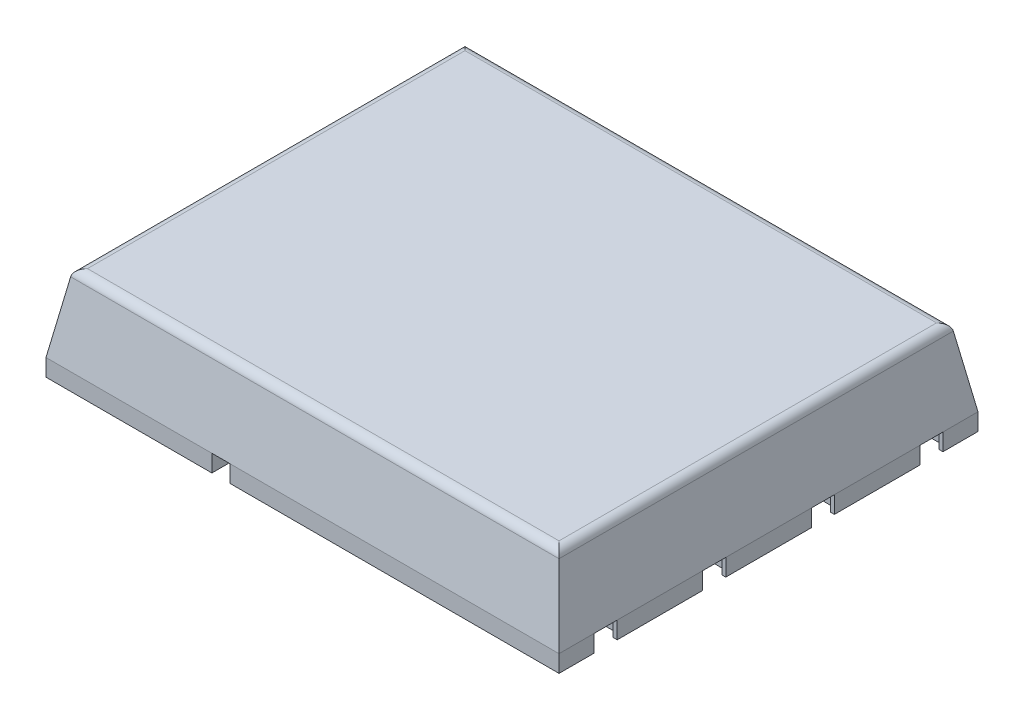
ISO-10303-21;
HEADER;
FILE_DESCRIPTION(('STEP AP214'),'2;1');
FILE_NAME('part.step','',(''),(''),'','','');
FILE_SCHEMA(('AUTOMOTIVE_DESIGN { 1 0 10303 214 1 1 1 1 }'));
ENDSEC;
DATA;
#1=APPLICATION_CONTEXT('core data for automotive mechanical design processes');
#2=APPLICATION_PROTOCOL_DEFINITION('international standard','automotive_design',2000,#1);
#3=PRODUCT_CONTEXT('',#1,'mechanical');
#4=PRODUCT('Part','Part','',(#3));
#5=PRODUCT_RELATED_PRODUCT_CATEGORY('part','',(#4));
#6=PRODUCT_DEFINITION_FORMATION('','',#4);
#7=PRODUCT_DEFINITION_CONTEXT('part definition',#1,'design');
#8=PRODUCT_DEFINITION('design','',#6,#7);
#9=PRODUCT_DEFINITION_SHAPE('','',#8);
#10=(LENGTH_UNIT() NAMED_UNIT(*) SI_UNIT(.MILLI.,.METRE.));
#11=(NAMED_UNIT(*) PLANE_ANGLE_UNIT() SI_UNIT($,.RADIAN.));
#12=(NAMED_UNIT(*) SI_UNIT($,.STERADIAN.) SOLID_ANGLE_UNIT());
#13=UNCERTAINTY_MEASURE_WITH_UNIT(LENGTH_MEASURE(1.E-05),#10,'distance_accuracy_value','');
#14=(GEOMETRIC_REPRESENTATION_CONTEXT(3) GLOBAL_UNCERTAINTY_ASSIGNED_CONTEXT((#13)) GLOBAL_UNIT_ASSIGNED_CONTEXT((#10,
#11,#12)) REPRESENTATION_CONTEXT('',''));
#15=CARTESIAN_POINT('',(0.,0.,0.));
#16=DIRECTION('',(0.,0.,1.));
#17=DIRECTION('',(1.,0.,0.));
#18=AXIS2_PLACEMENT_3D('',#15,#16,#17);
#19=CARTESIAN_POINT('',(0.,0.2,0.));
#20=DIRECTION('',(0.,1.,0.));
#21=DIRECTION('',(1.,0.,0.));
#22=AXIS2_PLACEMENT_3D('',#19,#20,#21);
#23=PLANE('',#22);
#24=DIRECTION('',(-1.,0.,0.));
#25=VECTOR('',#24,1.);
#26=CARTESIAN_POINT('',(-2.954141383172,0.2,-0.77));
#27=LINE('',#26,#25);
#28=CARTESIAN_POINT('',(-2.954141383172,0.2,-0.77));
#29=VERTEX_POINT('',#28);
#30=CARTESIAN_POINT('',(-3.,0.2,-0.77));
#31=VERTEX_POINT('',#30);
#32=EDGE_CURVE('E626',#29,#31,#27,.T.);
#33=ORIENTED_EDGE('',*,*,#32,.F.);
#34=DIRECTION('',(-0.625007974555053,0.,0.780618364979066));
#35=VECTOR('',#34,1.);
#36=CARTESIAN_POINT('',(-2.89809535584,0.2,-0.84));
#37=LINE('',#36,#35);
#38=CARTESIAN_POINT('',(-2.89809535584,0.2,-0.84));
#39=VERTEX_POINT('',#38);
#40=EDGE_CURVE('E618',#39,#29,#37,.T.);
#41=ORIENTED_EDGE('',*,*,#40,.F.);
#42=DIRECTION('',(-1.,0.,0.));
#43=VECTOR('',#42,1.);
#44=CARTESIAN_POINT('',(-2.52,0.2,-0.84));
#45=LINE('',#44,#43);
#46=CARTESIAN_POINT('',(-2.52,0.2,-0.84));
#47=VERTEX_POINT('',#46);
#48=EDGE_CURVE('E612',#47,#39,#45,.T.);
#49=ORIENTED_EDGE('',*,*,#48,.F.);
#50=DIRECTION('',(0.,0.,-1.));
#51=VECTOR('',#50,1.);
#52=CARTESIAN_POINT('',(-2.52,0.2,-0.43));
#53=LINE('',#52,#51);
#54=CARTESIAN_POINT('',(-2.52,0.2,-0.43));
#55=VERTEX_POINT('',#54);
#56=EDGE_CURVE('E1276',#55,#47,#53,.T.);
#57=ORIENTED_EDGE('',*,*,#56,.F.);
#58=DIRECTION('',(1.,0.,0.));
#59=VECTOR('',#58,1.);
#60=CARTESIAN_POINT('',(-2.89809535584,0.2,-0.43));
#61=LINE('',#60,#59);
#62=CARTESIAN_POINT('',(-2.89809535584,0.2,-0.43));
#63=VERTEX_POINT('',#62);
#64=EDGE_CURVE('E1272',#63,#55,#61,.T.);
#65=ORIENTED_EDGE('',*,*,#64,.F.);
#66=DIRECTION('',(0.625007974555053,0.,0.780618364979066));
#67=VECTOR('',#66,1.);
#68=CARTESIAN_POINT('',(-2.954141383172,0.2,-0.5));
#69=LINE('',#68,#67);
#70=CARTESIAN_POINT('',(-2.954141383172,0.2,-0.5));
#71=VERTEX_POINT('',#70);
#72=EDGE_CURVE('E1543',#71,#63,#69,.T.);
#73=ORIENTED_EDGE('',*,*,#72,.F.);
#74=DIRECTION('',(1.,0.,0.));
#75=VECTOR('',#74,1.);
#76=CARTESIAN_POINT('',(-3.,0.2,-0.5));
#77=LINE('',#76,#75);
#78=CARTESIAN_POINT('',(-3.,0.2,-0.5));
#79=VERTEX_POINT('',#78);
#80=EDGE_CURVE('E1538',#79,#71,#77,.T.);
#81=ORIENTED_EDGE('',*,*,#80,.F.);
#82=DIRECTION('',(0.,0.,1.));
#83=VECTOR('',#82,1.);
#84=CARTESIAN_POINT('',(-3.,0.2,-0.77));
#85=LINE('',#84,#83);
#86=EDGE_CURVE('E776',#31,#79,#85,.T.);
#87=ORIENTED_EDGE('',*,*,#86,.F.);
#88=EDGE_LOOP('',(#33,#41,#49,#57,#65,#73,#81,#87));
#89=FACE_BOUND('',#88,.T.);
#90=ADVANCED_FACE('F17',(#89),#23,.F.);
#91=CARTESIAN_POINT('',(0.,0.2,0.));
#92=DIRECTION('',(0.,1.,0.));
#93=DIRECTION('',(1.,0.,0.));
#94=AXIS2_PLACEMENT_3D('',#91,#92,#93);
#95=PLANE('',#94);
#96=DIRECTION('',(-1.,0.,0.));
#97=VECTOR('',#96,1.);
#98=CARTESIAN_POINT('',(-2.954141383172,0.2,0.5));
#99=LINE('',#98,#97);
#100=CARTESIAN_POINT('',(-2.954141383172,0.2,0.5));
#101=VERTEX_POINT('',#100);
#102=CARTESIAN_POINT('',(-3.,0.2,0.5));
#103=VERTEX_POINT('',#102);
#104=EDGE_CURVE('E1500',#101,#103,#99,.T.);
#105=ORIENTED_EDGE('',*,*,#104,.F.);
#106=DIRECTION('',(-0.625007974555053,0.,0.780618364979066));
#107=VECTOR('',#106,1.);
#108=CARTESIAN_POINT('',(-2.89809535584,0.2,0.43));
#109=LINE('',#108,#107);
#110=CARTESIAN_POINT('',(-2.89809535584,0.2,0.43));
#111=VERTEX_POINT('',#110);
#112=EDGE_CURVE('E1525',#111,#101,#109,.T.);
#113=ORIENTED_EDGE('',*,*,#112,.F.);
#114=DIRECTION('',(-1.,0.,0.));
#115=VECTOR('',#114,1.);
#116=CARTESIAN_POINT('',(-2.52,0.2,0.43));
#117=LINE('',#116,#115);
#118=CARTESIAN_POINT('',(-2.52,0.2,0.43));
#119=VERTEX_POINT('',#118);
#120=EDGE_CURVE('E1520',#119,#111,#117,.T.);
#121=ORIENTED_EDGE('',*,*,#120,.F.);
#122=DIRECTION('',(0.,0.,-1.));
#123=VECTOR('',#122,1.);
#124=CARTESIAN_POINT('',(-2.52,0.2,0.84));
#125=LINE('',#124,#123);
#126=CARTESIAN_POINT('',(-2.52,0.2,0.84));
#127=VERTEX_POINT('',#126);
#128=EDGE_CURVE('E1329',#127,#119,#125,.T.);
#129=ORIENTED_EDGE('',*,*,#128,.F.);
#130=DIRECTION('',(1.,0.,0.));
#131=VECTOR('',#130,1.);
#132=CARTESIAN_POINT('',(-2.89809535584,0.2,0.84));
#133=LINE('',#132,#131);
#134=CARTESIAN_POINT('',(-2.89809535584,0.2,0.84));
#135=VERTEX_POINT('',#134);
#136=EDGE_CURVE('E1499',#135,#127,#133,.T.);
#137=ORIENTED_EDGE('',*,*,#136,.F.);
#138=DIRECTION('',(0.625007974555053,0.,0.780618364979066));
#139=VECTOR('',#138,1.);
#140=CARTESIAN_POINT('',(-2.954141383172,0.2,0.77));
#141=LINE('',#140,#139);
#142=CARTESIAN_POINT('',(-2.954141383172,0.2,0.77));
#143=VERTEX_POINT('',#142);
#144=EDGE_CURVE('E1511',#143,#135,#141,.T.);
#145=ORIENTED_EDGE('',*,*,#144,.F.);
#146=DIRECTION('',(1.,0.,0.));
#147=VECTOR('',#146,1.);
#148=CARTESIAN_POINT('',(-3.,0.2,0.77));
#149=LINE('',#148,#147);
#150=CARTESIAN_POINT('',(-3.,0.2,0.77));
#151=VERTEX_POINT('',#150);
#152=EDGE_CURVE('E1492',#151,#143,#149,.T.);
#153=ORIENTED_EDGE('',*,*,#152,.F.);
#154=DIRECTION('',(0.,0.,1.));
#155=VECTOR('',#154,1.);
#156=CARTESIAN_POINT('',(-3.,0.2,0.5));
#157=LINE('',#156,#155);
#158=EDGE_CURVE('E773',#103,#151,#157,.T.);
#159=ORIENTED_EDGE('',*,*,#158,.F.);
#160=EDGE_LOOP('',(#105,#113,#121,#129,#137,#145,#153,#159));
#161=FACE_BOUND('',#160,.T.);
#162=ADVANCED_FACE('F19',(#161),#95,.F.);
#163=CARTESIAN_POINT('',(0.,0.2,0.));
#164=DIRECTION('',(0.,1.,0.));
#165=DIRECTION('',(1.,0.,0.));
#166=AXIS2_PLACEMENT_3D('',#163,#164,#165);
#167=PLANE('',#166);
#168=DIRECTION('',(-1.,0.,0.));
#169=VECTOR('',#168,1.);
#170=CARTESIAN_POINT('',(-2.954141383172,0.2,1.77));
#171=LINE('',#170,#169);
#172=CARTESIAN_POINT('',(-2.954141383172,0.2,1.77));
#173=VERTEX_POINT('',#172);
#174=CARTESIAN_POINT('',(-3.,0.2,1.77));
#175=VERTEX_POINT('',#174);
#176=EDGE_CURVE('E1416',#173,#175,#171,.T.);
#177=ORIENTED_EDGE('',*,*,#176,.F.);
#178=DIRECTION('',(-0.625007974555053,0.,0.780618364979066));
#179=VECTOR('',#178,1.);
#180=CARTESIAN_POINT('',(-2.89809535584,0.2,1.7));
#181=LINE('',#180,#179);
#182=CARTESIAN_POINT('',(-2.89809535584,0.2,1.7));
#183=VERTEX_POINT('',#182);
#184=EDGE_CURVE('E1341',#183,#173,#181,.T.);
#185=ORIENTED_EDGE('',*,*,#184,.F.);
#186=DIRECTION('',(-1.,0.,0.));
#187=VECTOR('',#186,1.);
#188=CARTESIAN_POINT('',(-2.52,0.2,1.7));
#189=LINE('',#188,#187);
#190=CARTESIAN_POINT('',(-2.52,0.2,1.7));
#191=VERTEX_POINT('',#190);
#192=EDGE_CURVE('E1342',#191,#183,#189,.T.);
#193=ORIENTED_EDGE('',*,*,#192,.F.);
#194=DIRECTION('',(0.,0.,-1.));
#195=VECTOR('',#194,1.);
#196=CARTESIAN_POINT('',(-2.52,0.2,2.11));
#197=LINE('',#196,#195);
#198=CARTESIAN_POINT('',(-2.52,0.2,2.11));
#199=VERTEX_POINT('',#198);
#200=EDGE_CURVE('E1474',#199,#191,#197,.T.);
#201=ORIENTED_EDGE('',*,*,#200,.F.);
#202=DIRECTION('',(1.,0.,0.));
#203=VECTOR('',#202,1.);
#204=CARTESIAN_POINT('',(-2.89809535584,0.2,2.11));
#205=LINE('',#204,#203);
#206=CARTESIAN_POINT('',(-2.89809535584,0.2,2.11));
#207=VERTEX_POINT('',#206);
#208=EDGE_CURVE('E1469',#207,#199,#205,.T.);
#209=ORIENTED_EDGE('',*,*,#208,.F.);
#210=DIRECTION('',(0.625007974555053,0.,0.780618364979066));
#211=VECTOR('',#210,1.);
#212=CARTESIAN_POINT('',(-2.954141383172,0.2,2.04));
#213=LINE('',#212,#211);
#214=CARTESIAN_POINT('',(-2.954141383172,0.2,2.04));
#215=VERTEX_POINT('',#214);
#216=EDGE_CURVE('E1455',#215,#207,#213,.T.);
#217=ORIENTED_EDGE('',*,*,#216,.F.);
#218=DIRECTION('',(1.,0.,0.));
#219=VECTOR('',#218,1.);
#220=CARTESIAN_POINT('',(-3.,0.2,2.04));
#221=LINE('',#220,#219);
#222=CARTESIAN_POINT('',(-3.,0.2,2.04));
#223=VERTEX_POINT('',#222);
#224=EDGE_CURVE('E1456',#223,#215,#221,.T.);
#225=ORIENTED_EDGE('',*,*,#224,.F.);
#226=DIRECTION('',(0.,0.,1.));
#227=VECTOR('',#226,1.);
#228=CARTESIAN_POINT('',(-3.,0.2,1.77));
#229=LINE('',#228,#227);
#230=EDGE_CURVE('E447',#175,#223,#229,.T.);
#231=ORIENTED_EDGE('',*,*,#230,.F.);
#232=EDGE_LOOP('',(#177,#185,#193,#201,#209,#217,#225,#231));
#233=FACE_BOUND('',#232,.T.);
#234=ADVANCED_FACE('F3703',(#233),#167,.F.);
#235=CARTESIAN_POINT('',(10.8216,1.,-2.207395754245));
#236=DIRECTION('',(-1.,0.,0.));
#237=DIRECTION('',(0.,-0.766044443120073,0.642787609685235));
#238=AXIS2_PLACEMENT_3D('',#235,#236,#237);
#239=CYLINDRICAL_SURFACE('',#238,0.1);
#240=CARTESIAN_POINT('',(2.757395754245,1.,-2.207395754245));
#241=DIRECTION('',(-0.707106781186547,0.,-0.707106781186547));
#242=DIRECTION('',(0.707106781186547,0.,-0.707106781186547));
#243=AXIS2_PLACEMENT_3D('',#240,#241,#242);
#244=ELLIPSE('',#243,0.14142135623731,0.1);
#245=CARTESIAN_POINT('',(2.85587652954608,1.01736481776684,-2.30587652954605));
#246=VERTEX_POINT('',#245);
#247=CARTESIAN_POINT('',(2.757395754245,1.1,-2.207395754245));
#248=VERTEX_POINT('',#247);
#249=EDGE_CURVE('E409',#246,#248,#244,.F.);
#250=ORIENTED_EDGE('',*,*,#249,.F.);
#251=DIRECTION('',(-1.,0.,0.));
#252=VECTOR('',#251,1.);
#253=CARTESIAN_POINT('',(2.855876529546,1.017364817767,-2.305876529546));
#254=LINE('',#253,#252);
#255=CARTESIAN_POINT('',(-2.85587652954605,1.01736481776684,-2.30587652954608));
#256=VERTEX_POINT('',#255);
#257=EDGE_CURVE('E414',#246,#256,#254,.T.);
#258=ORIENTED_EDGE('',*,*,#257,.T.);
#259=CARTESIAN_POINT('',(-2.757395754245,1.,-2.207395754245));
#260=DIRECTION('',(-0.707106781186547,0.,0.707106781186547));
#261=DIRECTION('',(-0.707106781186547,0.,-0.707106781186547));
#262=AXIS2_PLACEMENT_3D('',#259,#260,#261);
#263=ELLIPSE('',#262,0.14142135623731,0.1);
#264=CARTESIAN_POINT('',(-2.757395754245,1.1,-2.207395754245));
#265=VERTEX_POINT('',#264);
#266=EDGE_CURVE('E438',#256,#265,#263,.F.);
#267=ORIENTED_EDGE('',*,*,#266,.T.);
#268=DIRECTION('',(-1.,0.,0.));
#269=VECTOR('',#268,1.);
#270=CARTESIAN_POINT('',(2.757395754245,1.1,-2.207395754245));
#271=LINE('',#270,#269);
#272=EDGE_CURVE('E423',#248,#265,#271,.T.);
#273=ORIENTED_EDGE('',*,*,#272,.F.);
#274=EDGE_LOOP('',(#250,#258,#267,#273));
#275=FACE_BOUND('',#274,.T.);
#276=ADVANCED_FACE('F478',(#275),#239,.T.);
#277=CARTESIAN_POINT('',(2.954141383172,-0.05,1.77));
#278=DIRECTION('',(0.780618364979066,0.,-0.625007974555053));
#279=DIRECTION('',(0.,-1.,0.));
#280=AXIS2_PLACEMENT_3D('',#277,#278,#279);
#281=PLANE('',#280);
#282=DIRECTION('',(0.,1.,0.));
#283=VECTOR('',#282,1.);
#284=CARTESIAN_POINT('',(2.954141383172,0.,1.77));
#285=LINE('',#284,#283);
#286=CARTESIAN_POINT('',(2.954141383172,0.,1.77));
#287=VERTEX_POINT('',#286);
#288=CARTESIAN_POINT('',(2.954141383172,0.2,1.77));
#289=VERTEX_POINT('',#288);
#290=EDGE_CURVE('E764',#287,#289,#285,.T.);
#291=ORIENTED_EDGE('',*,*,#290,.T.);
#292=DIRECTION('',(-0.625007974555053,0.,-0.780618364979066));
#293=VECTOR('',#292,1.);
#294=CARTESIAN_POINT('',(2.954141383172,0.2,1.77));
#295=LINE('',#294,#293);
#296=CARTESIAN_POINT('',(2.89809535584,0.2,1.7));
#297=VERTEX_POINT('',#296);
#298=EDGE_CURVE('E900',#289,#297,#295,.T.);
#299=ORIENTED_EDGE('',*,*,#298,.T.);
#300=DIRECTION('',(0.,1.,0.));
#301=VECTOR('',#300,1.);
#302=CARTESIAN_POINT('',(2.89809535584,0.,1.7));
#303=LINE('',#302,#301);
#304=CARTESIAN_POINT('',(2.89809535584,0.,1.7));
#305=VERTEX_POINT('',#304);
#306=EDGE_CURVE('E11',#305,#297,#303,.T.);
#307=ORIENTED_EDGE('',*,*,#306,.F.);
#308=DIRECTION('',(-0.625007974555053,0.,-0.780618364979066));
#309=VECTOR('',#308,1.);
#310=CARTESIAN_POINT('',(2.954141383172,0.,1.77));
#311=LINE('',#310,#309);
#312=EDGE_CURVE('E393',#287,#305,#311,.T.);
#313=ORIENTED_EDGE('',*,*,#312,.F.);
#314=EDGE_LOOP('',(#291,#299,#307,#313));
#315=FACE_BOUND('',#314,.T.);
#316=ADVANCED_FACE('F1157',(#315),#281,.F.);
#317=CARTESIAN_POINT('',(2.89809535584,-0.05,1.7));
#318=DIRECTION('',(0.,0.,-1.));
#319=DIRECTION('',(0.,-1.,0.));
#320=AXIS2_PLACEMENT_3D('',#317,#318,#319);
#321=PLANE('',#320);
#322=ORIENTED_EDGE('',*,*,#306,.T.);
#323=DIRECTION('',(-1.,0.,0.));
#324=VECTOR('',#323,1.);
#325=CARTESIAN_POINT('',(2.89809535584,0.2,1.7));
#326=LINE('',#325,#324);
#327=CARTESIAN_POINT('',(2.62,0.2,1.7));
#328=VERTEX_POINT('',#327);
#329=EDGE_CURVE('E896',#297,#328,#326,.T.);
#330=ORIENTED_EDGE('',*,*,#329,.T.);
#331=DIRECTION('',(0.,1.,0.));
#332=VECTOR('',#331,1.);
#333=CARTESIAN_POINT('',(2.62,0.,1.7));
#334=LINE('',#333,#332);
#335=CARTESIAN_POINT('',(2.62,0.,1.7));
#336=VERTEX_POINT('',#335);
#337=EDGE_CURVE('E28',#336,#328,#334,.T.);
#338=ORIENTED_EDGE('',*,*,#337,.F.);
#339=DIRECTION('',(-1.,0.,0.));
#340=VECTOR('',#339,1.);
#341=CARTESIAN_POINT('',(2.89809535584,0.,1.7));
#342=LINE('',#341,#340);
#343=EDGE_CURVE('E386',#305,#336,#342,.T.);
#344=ORIENTED_EDGE('',*,*,#343,.F.);
#345=EDGE_LOOP('',(#322,#330,#338,#344));
#346=FACE_BOUND('',#345,.T.);
#347=ADVANCED_FACE('F1161',(#346),#321,.F.);
#348=CARTESIAN_POINT('',(2.62,-0.05,1.7));
#349=DIRECTION('',(1.,0.,0.));
#350=DIRECTION('',(0.,1.,0.));
#351=AXIS2_PLACEMENT_3D('',#348,#349,#350);
#352=PLANE('',#351);
#353=ORIENTED_EDGE('',*,*,#337,.T.);
#354=DIRECTION('',(0.,0.,-1.));
#355=VECTOR('',#354,1.);
#356=CARTESIAN_POINT('',(2.62,0.2,1.7));
#357=LINE('',#356,#355);
#358=CARTESIAN_POINT('',(2.62,0.2,0.84));
#359=VERTEX_POINT('',#358);
#360=EDGE_CURVE('E368',#328,#359,#357,.T.);
#361=ORIENTED_EDGE('',*,*,#360,.T.);
#362=DIRECTION('',(0.,1.,0.));
#363=VECTOR('',#362,1.);
#364=CARTESIAN_POINT('',(2.62,0.,0.84));
#365=LINE('',#364,#363);
#366=CARTESIAN_POINT('',(2.62,0.,0.84));
#367=VERTEX_POINT('',#366);
#368=EDGE_CURVE('E361',#367,#359,#365,.T.);
#369=ORIENTED_EDGE('',*,*,#368,.F.);
#370=DIRECTION('',(0.,0.,-1.));
#371=VECTOR('',#370,1.);
#372=CARTESIAN_POINT('',(2.62,0.,1.7));
#373=LINE('',#372,#371);
#374=EDGE_CURVE('E365',#336,#367,#373,.T.);
#375=ORIENTED_EDGE('',*,*,#374,.F.);
#376=EDGE_LOOP('',(#353,#361,#369,#375));
#377=FACE_BOUND('',#376,.T.);
#378=ADVANCED_FACE('F363',(#377),#352,.F.);
#379=CARTESIAN_POINT('',(2.62,-0.05,0.84));
#380=DIRECTION('',(0.,0.,1.));
#381=DIRECTION('',(1.,0.,0.));
#382=AXIS2_PLACEMENT_3D('',#379,#380,#381);
#383=PLANE('',#382);
#384=ORIENTED_EDGE('',*,*,#368,.T.);
#385=DIRECTION('',(1.,0.,0.));
#386=VECTOR('',#385,1.);
#387=CARTESIAN_POINT('',(2.62,0.2,0.84));
#388=LINE('',#387,#386);
#389=CARTESIAN_POINT('',(2.89809535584,0.2,0.84));
#390=VERTEX_POINT('',#389);
#391=EDGE_CURVE('E891',#359,#390,#388,.T.);
#392=ORIENTED_EDGE('',*,*,#391,.T.);
#393=DIRECTION('',(0.,1.,0.));
#394=VECTOR('',#393,1.);
#395=CARTESIAN_POINT('',(2.89809535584,0.,0.84));
#396=LINE('',#395,#394);
#397=CARTESIAN_POINT('',(2.89809535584,0.,0.84));
#398=VERTEX_POINT('',#397);
#399=EDGE_CURVE('E373',#398,#390,#396,.T.);
#400=ORIENTED_EDGE('',*,*,#399,.F.);
#401=DIRECTION('',(1.,0.,0.));
#402=VECTOR('',#401,1.);
#403=CARTESIAN_POINT('',(2.62,0.,0.84));
#404=LINE('',#403,#402);
#405=EDGE_CURVE('E376',#367,#398,#404,.T.);
#406=ORIENTED_EDGE('',*,*,#405,.F.);
#407=EDGE_LOOP('',(#384,#392,#400,#406));
#408=FACE_BOUND('',#407,.T.);
#409=ADVANCED_FACE('F377',(#408),#383,.F.);
#410=CARTESIAN_POINT('',(2.89809535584,-0.05,0.84));
#411=DIRECTION('',(0.780618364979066,0.,0.625007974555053));
#412=DIRECTION('',(0.,-1.,0.));
#413=AXIS2_PLACEMENT_3D('',#410,#411,#412);
#414=PLANE('',#413);
#415=ORIENTED_EDGE('',*,*,#399,.T.);
#416=DIRECTION('',(0.625007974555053,0.,-0.780618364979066));
#417=VECTOR('',#416,1.);
#418=CARTESIAN_POINT('',(2.89809535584,0.2,0.84));
#419=LINE('',#418,#417);
#420=CARTESIAN_POINT('',(2.954141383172,0.2,0.77));
#421=VERTEX_POINT('',#420);
#422=EDGE_CURVE('E888',#390,#421,#419,.T.);
#423=ORIENTED_EDGE('',*,*,#422,.T.);
#424=DIRECTION('',(0.,1.,0.));
#425=VECTOR('',#424,1.);
#426=CARTESIAN_POINT('',(2.954141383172,0.,0.77));
#427=LINE('',#426,#425);
#428=CARTESIAN_POINT('',(2.954141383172,0.,0.77));
#429=VERTEX_POINT('',#428);
#430=EDGE_CURVE('E43',#429,#421,#427,.T.);
#431=ORIENTED_EDGE('',*,*,#430,.F.);
#432=DIRECTION('',(0.625007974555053,0.,-0.780618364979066));
#433=VECTOR('',#432,1.);
#434=CARTESIAN_POINT('',(2.89809535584,0.,0.84));
#435=LINE('',#434,#433);
#436=EDGE_CURVE('E381',#398,#429,#435,.T.);
#437=ORIENTED_EDGE('',*,*,#436,.F.);
#438=EDGE_LOOP('',(#415,#423,#431,#437));
#439=FACE_BOUND('',#438,.T.);
#440=ADVANCED_FACE('F2871',(#439),#414,.F.);
#441=CARTESIAN_POINT('',(2.954141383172,-0.05,0.77));
#442=DIRECTION('',(0.,0.,1.));
#443=DIRECTION('',(1.,0.,0.));
#444=AXIS2_PLACEMENT_3D('',#441,#442,#443);
#445=PLANE('',#444);
#446=ORIENTED_EDGE('',*,*,#430,.T.);
#447=DIRECTION('',(1.,0.,0.));
#448=VECTOR('',#447,1.);
#449=CARTESIAN_POINT('',(2.954141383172,0.2,0.77));
#450=LINE('',#449,#448);
#451=CARTESIAN_POINT('',(3.,0.2,0.77));
#452=VERTEX_POINT('',#451);
#453=EDGE_CURVE('E884',#421,#452,#450,.T.);
#454=ORIENTED_EDGE('',*,*,#453,.T.);
#455=DIRECTION('',(0.,1.,0.));
#456=VECTOR('',#455,1.);
#457=CARTESIAN_POINT('',(3.,0.,0.77));
#458=LINE('',#457,#456);
#459=CARTESIAN_POINT('',(3.,0.,0.77));
#460=VERTEX_POINT('',#459);
#461=EDGE_CURVE('E922',#460,#452,#458,.T.);
#462=ORIENTED_EDGE('',*,*,#461,.F.);
#463=DIRECTION('',(-1.,0.,0.));
#464=VECTOR('',#463,1.);
#465=CARTESIAN_POINT('',(3.,0.,0.77));
#466=LINE('',#465,#464);
#467=EDGE_CURVE('E397',#460,#429,#466,.T.);
#468=ORIENTED_EDGE('',*,*,#467,.T.);
#469=EDGE_LOOP('',(#446,#454,#462,#468));
#470=FACE_BOUND('',#469,.T.);
#471=ADVANCED_FACE('F2875',(#470),#445,.F.);
#472=CARTESIAN_POINT('',(0.,0.,0.));
#473=DIRECTION('',(0.,1.,0.));
#474=DIRECTION('',(1.,0.,0.));
#475=AXIS2_PLACEMENT_3D('',#472,#473,#474);
#476=PLANE('',#475);
#477=ORIENTED_EDGE('',*,*,#312,.T.);
#478=ORIENTED_EDGE('',*,*,#343,.T.);
#479=ORIENTED_EDGE('',*,*,#374,.T.);
#480=ORIENTED_EDGE('',*,*,#405,.T.);
#481=ORIENTED_EDGE('',*,*,#436,.T.);
#482=ORIENTED_EDGE('',*,*,#467,.F.);
#483=DIRECTION('',(0.,0.,-1.));
#484=VECTOR('',#483,1.);
#485=CARTESIAN_POINT('',(3.,0.,1.77));
#486=LINE('',#485,#484);
#487=CARTESIAN_POINT('',(3.,0.,1.77));
#488=VERTEX_POINT('',#487);
#489=EDGE_CURVE('E926',#488,#460,#486,.T.);
#490=ORIENTED_EDGE('',*,*,#489,.F.);
#491=DIRECTION('',(-1.,0.,0.));
#492=VECTOR('',#491,1.);
#493=CARTESIAN_POINT('',(3.,0.,1.77));
#494=LINE('',#493,#492);
#495=EDGE_CURVE('E1148',#488,#287,#494,.T.);
#496=ORIENTED_EDGE('',*,*,#495,.T.);
#497=EDGE_LOOP('',(#477,#478,#479,#480,#481,#482,#490,#496));
#498=FACE_BOUND('',#497,.T.);
#499=ADVANCED_FACE('F384',(#498),#476,.F.);
#500=CARTESIAN_POINT('',(3.13,-0.05,1.77));
#501=DIRECTION('',(0.,0.,-1.));
#502=DIRECTION('',(0.,-1.,0.));
#503=AXIS2_PLACEMENT_3D('',#500,#501,#502);
#504=PLANE('',#503);
#505=DIRECTION('',(0.,1.,0.));
#506=VECTOR('',#505,1.);
#507=CARTESIAN_POINT('',(3.,0.,1.77));
#508=LINE('',#507,#506);
#509=CARTESIAN_POINT('',(3.,0.2,1.77));
#510=VERTEX_POINT('',#509);
#511=EDGE_CURVE('E925',#488,#510,#508,.T.);
#512=ORIENTED_EDGE('',*,*,#511,.T.);
#513=DIRECTION('',(-1.,0.,0.));
#514=VECTOR('',#513,1.);
#515=CARTESIAN_POINT('',(3.,0.2,1.77));
#516=LINE('',#515,#514);
#517=EDGE_CURVE('E904',#510,#289,#516,.T.);
#518=ORIENTED_EDGE('',*,*,#517,.T.);
#519=ORIENTED_EDGE('',*,*,#290,.F.);
#520=ORIENTED_EDGE('',*,*,#495,.F.);
#521=EDGE_LOOP('',(#512,#518,#519,#520));
#522=FACE_BOUND('',#521,.T.);
#523=ADVANCED_FACE('F2898',(#522),#504,.F.);
#524=CARTESIAN_POINT('',(3.,0.,2.45));
#525=DIRECTION('',(1.,0.,0.));
#526=DIRECTION('',(0.,1.,0.));
#527=AXIS2_PLACEMENT_3D('',#524,#525,#526);
#528=PLANE('',#527);
#529=ORIENTED_EDGE('',*,*,#489,.T.);
#530=ORIENTED_EDGE('',*,*,#461,.T.);
#531=DIRECTION('',(0.,0.,-1.));
#532=VECTOR('',#531,1.);
#533=CARTESIAN_POINT('',(3.,0.2,1.77));
#534=LINE('',#533,#532);
#535=EDGE_CURVE('E408',#510,#452,#534,.T.);
#536=ORIENTED_EDGE('',*,*,#535,.F.);
#537=ORIENTED_EDGE('',*,*,#511,.F.);
#538=EDGE_LOOP('',(#529,#530,#536,#537));
#539=FACE_BOUND('',#538,.T.);
#540=ADVANCED_FACE('F2902',(#539),#528,.T.);
#541=CARTESIAN_POINT('',(2.954141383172,-0.05,0.5));
#542=DIRECTION('',(0.780618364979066,0.,-0.625007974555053));
#543=DIRECTION('',(0.,-1.,0.));
#544=AXIS2_PLACEMENT_3D('',#541,#542,#543);
#545=PLANE('',#544);
#546=DIRECTION('',(0.,1.,0.));
#547=VECTOR('',#546,1.);
#548=CARTESIAN_POINT('',(2.954141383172,0.,0.5));
#549=LINE('',#548,#547);
#550=CARTESIAN_POINT('',(2.954141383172,0.,0.5));
#551=VERTEX_POINT('',#550);
#552=CARTESIAN_POINT('',(2.954141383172,0.2,0.5));
#553=VERTEX_POINT('',#552);
#554=EDGE_CURVE('E868',#551,#553,#549,.T.);
#555=ORIENTED_EDGE('',*,*,#554,.T.);
#556=DIRECTION('',(-0.625007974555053,0.,-0.780618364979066));
#557=VECTOR('',#556,1.);
#558=CARTESIAN_POINT('',(2.954141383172,0.2,0.5));
#559=LINE('',#558,#557);
#560=CARTESIAN_POINT('',(2.89809535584,0.2,0.43));
#561=VERTEX_POINT('',#560);
#562=EDGE_CURVE('E872',#553,#561,#559,.T.);
#563=ORIENTED_EDGE('',*,*,#562,.T.);
#564=DIRECTION('',(0.,1.,0.));
#565=VECTOR('',#564,1.);
#566=CARTESIAN_POINT('',(2.89809535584,0.,0.43));
#567=LINE('',#566,#565);
#568=CARTESIAN_POINT('',(2.89809535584,0.,0.43));
#569=VERTEX_POINT('',#568);
#570=EDGE_CURVE('E1141',#569,#561,#567,.T.);
#571=ORIENTED_EDGE('',*,*,#570,.F.);
#572=DIRECTION('',(-0.625007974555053,0.,-0.780618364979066));
#573=VECTOR('',#572,1.);
#574=CARTESIAN_POINT('',(2.954141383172,0.,0.5));
#575=LINE('',#574,#573);
#576=EDGE_CURVE('E867',#551,#569,#575,.T.);
#577=ORIENTED_EDGE('',*,*,#576,.F.);
#578=EDGE_LOOP('',(#555,#563,#571,#577));
#579=FACE_BOUND('',#578,.T.);
#580=ADVANCED_FACE('F3265',(#579),#545,.F.);
#581=CARTESIAN_POINT('',(2.89809535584,-0.05,0.43));
#582=DIRECTION('',(0.,0.,-1.));
#583=DIRECTION('',(0.,-1.,0.));
#584=AXIS2_PLACEMENT_3D('',#581,#582,#583);
#585=PLANE('',#584);
#586=ORIENTED_EDGE('',*,*,#570,.T.);
#587=DIRECTION('',(-1.,0.,0.));
#588=VECTOR('',#587,1.);
#589=CARTESIAN_POINT('',(2.89809535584,0.2,0.43));
#590=LINE('',#589,#588);
#591=CARTESIAN_POINT('',(2.62,0.2,0.43));
#592=VERTEX_POINT('',#591);
#593=EDGE_CURVE('E862',#561,#592,#590,.T.);
#594=ORIENTED_EDGE('',*,*,#593,.T.);
#595=DIRECTION('',(0.,1.,0.));
#596=VECTOR('',#595,1.);
#597=CARTESIAN_POINT('',(2.62,0.,0.43));
#598=LINE('',#597,#596);
#599=CARTESIAN_POINT('',(2.62,0.,0.43));
#600=VERTEX_POINT('',#599);
#601=EDGE_CURVE('E1138',#600,#592,#598,.T.);
#602=ORIENTED_EDGE('',*,*,#601,.F.);
#603=DIRECTION('',(-1.,0.,0.));
#604=VECTOR('',#603,1.);
#605=CARTESIAN_POINT('',(2.89809535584,0.,0.43));
#606=LINE('',#605,#604);
#607=EDGE_CURVE('E1110',#569,#600,#606,.T.);
#608=ORIENTED_EDGE('',*,*,#607,.F.);
#609=EDGE_LOOP('',(#586,#594,#602,#608));
#610=FACE_BOUND('',#609,.T.);
#611=ADVANCED_FACE('F3219',(#610),#585,.F.);
#612=CARTESIAN_POINT('',(2.62,-0.05,0.43));
#613=DIRECTION('',(1.,0.,0.));
#614=DIRECTION('',(0.,1.,0.));
#615=AXIS2_PLACEMENT_3D('',#612,#613,#614);
#616=PLANE('',#615);
#617=ORIENTED_EDGE('',*,*,#601,.T.);
#618=DIRECTION('',(0.,0.,-1.));
#619=VECTOR('',#618,1.);
#620=CARTESIAN_POINT('',(2.62,0.2,0.43));
#621=LINE('',#620,#619);
#622=CARTESIAN_POINT('',(2.62,0.2,-0.43));
#623=VERTEX_POINT('',#622);
#624=EDGE_CURVE('E858',#592,#623,#621,.T.);
#625=ORIENTED_EDGE('',*,*,#624,.T.);
#626=DIRECTION('',(0.,1.,0.));
#627=VECTOR('',#626,1.);
#628=CARTESIAN_POINT('',(2.62,0.,-0.43));
#629=LINE('',#628,#627);
#630=CARTESIAN_POINT('',(2.62,0.,-0.43));
#631=VERTEX_POINT('',#630);
#632=EDGE_CURVE('E1131',#631,#623,#629,.T.);
#633=ORIENTED_EDGE('',*,*,#632,.F.);
#634=DIRECTION('',(0.,0.,-1.));
#635=VECTOR('',#634,1.);
#636=CARTESIAN_POINT('',(2.62,0.,0.43));
#637=LINE('',#636,#635);
#638=EDGE_CURVE('E1114',#600,#631,#637,.T.);
#639=ORIENTED_EDGE('',*,*,#638,.F.);
#640=EDGE_LOOP('',(#617,#625,#633,#639));
#641=FACE_BOUND('',#640,.T.);
#642=ADVANCED_FACE('F3214',(#641),#616,.F.);
#643=CARTESIAN_POINT('',(2.62,-0.05,-0.43));
#644=DIRECTION('',(0.,0.,1.));
#645=DIRECTION('',(1.,0.,0.));
#646=AXIS2_PLACEMENT_3D('',#643,#644,#645);
#647=PLANE('',#646);
#648=ORIENTED_EDGE('',*,*,#632,.T.);
#649=DIRECTION('',(1.,0.,0.));
#650=VECTOR('',#649,1.);
#651=CARTESIAN_POINT('',(2.62,0.2,-0.43));
#652=LINE('',#651,#650);
#653=CARTESIAN_POINT('',(2.89809535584,0.2,-0.43));
#654=VERTEX_POINT('',#653);
#655=EDGE_CURVE('E848',#623,#654,#652,.T.);
#656=ORIENTED_EDGE('',*,*,#655,.T.);
#657=DIRECTION('',(0.,1.,0.));
#658=VECTOR('',#657,1.);
#659=CARTESIAN_POINT('',(2.89809535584,0.,-0.43));
#660=LINE('',#659,#658);
#661=CARTESIAN_POINT('',(2.89809535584,0.,-0.43));
#662=VERTEX_POINT('',#661);
#663=EDGE_CURVE('E1128',#662,#654,#660,.T.);
#664=ORIENTED_EDGE('',*,*,#663,.F.);
#665=DIRECTION('',(1.,0.,0.));
#666=VECTOR('',#665,1.);
#667=CARTESIAN_POINT('',(2.62,0.,-0.43));
#668=LINE('',#667,#666);
#669=EDGE_CURVE('E1118',#631,#662,#668,.T.);
#670=ORIENTED_EDGE('',*,*,#669,.F.);
#671=EDGE_LOOP('',(#648,#656,#664,#670));
#672=FACE_BOUND('',#671,.T.);
#673=ADVANCED_FACE('F3218',(#672),#647,.F.);
#674=CARTESIAN_POINT('',(2.89809535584,-0.05,-0.43));
#675=DIRECTION('',(0.780618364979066,0.,0.625007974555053));
#676=DIRECTION('',(0.,-1.,0.));
#677=AXIS2_PLACEMENT_3D('',#674,#675,#676);
#678=PLANE('',#677);
#679=ORIENTED_EDGE('',*,*,#663,.T.);
#680=DIRECTION('',(0.625007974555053,0.,-0.780618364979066));
#681=VECTOR('',#680,1.);
#682=CARTESIAN_POINT('',(2.89809535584,0.2,-0.43));
#683=LINE('',#682,#681);
#684=CARTESIAN_POINT('',(2.954141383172,0.2,-0.5));
#685=VERTEX_POINT('',#684);
#686=EDGE_CURVE('E844',#654,#685,#683,.T.);
#687=ORIENTED_EDGE('',*,*,#686,.T.);
#688=DIRECTION('',(0.,1.,0.));
#689=VECTOR('',#688,1.);
#690=CARTESIAN_POINT('',(2.954141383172,0.,-0.5));
#691=LINE('',#690,#689);
#692=CARTESIAN_POINT('',(2.954141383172,0.,-0.5));
#693=VERTEX_POINT('',#692);
#694=EDGE_CURVE('E1127',#693,#685,#691,.T.);
#695=ORIENTED_EDGE('',*,*,#694,.F.);
#696=DIRECTION('',(0.625007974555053,0.,-0.780618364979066));
#697=VECTOR('',#696,1.);
#698=CARTESIAN_POINT('',(2.89809535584,0.,-0.43));
#699=LINE('',#698,#697);
#700=EDGE_CURVE('E1119',#662,#693,#699,.T.);
#701=ORIENTED_EDGE('',*,*,#700,.F.);
#702=EDGE_LOOP('',(#679,#687,#695,#701));
#703=FACE_BOUND('',#702,.T.);
#704=ADVANCED_FACE('F3458',(#703),#678,.F.);
#705=CARTESIAN_POINT('',(2.954141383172,-0.05,-0.5));
#706=DIRECTION('',(0.,0.,1.));
#707=DIRECTION('',(1.,0.,0.));
#708=AXIS2_PLACEMENT_3D('',#705,#706,#707);
#709=PLANE('',#708);
#710=ORIENTED_EDGE('',*,*,#694,.T.);
#711=DIRECTION('',(1.,0.,0.));
#712=VECTOR('',#711,1.);
#713=CARTESIAN_POINT('',(2.954141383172,0.2,-0.5));
#714=LINE('',#713,#712);
#715=CARTESIAN_POINT('',(3.,0.2,-0.5));
#716=VERTEX_POINT('',#715);
#717=EDGE_CURVE('E840',#685,#716,#714,.T.);
#718=ORIENTED_EDGE('',*,*,#717,.T.);
#719=DIRECTION('',(0.,1.,0.));
#720=VECTOR('',#719,1.);
#721=CARTESIAN_POINT('',(3.,0.,-0.5));
#722=LINE('',#721,#720);
#723=CARTESIAN_POINT('',(3.,0.,-0.5));
#724=VERTEX_POINT('',#723);
#725=EDGE_CURVE('E1060',#724,#716,#722,.T.);
#726=ORIENTED_EDGE('',*,*,#725,.F.);
#727=DIRECTION('',(-1.,0.,0.));
#728=VECTOR('',#727,1.);
#729=CARTESIAN_POINT('',(3.,0.,-0.5));
#730=LINE('',#729,#728);
#731=EDGE_CURVE('E1123',#724,#693,#730,.T.);
#732=ORIENTED_EDGE('',*,*,#731,.T.);
#733=EDGE_LOOP('',(#710,#718,#726,#732));
#734=FACE_BOUND('',#733,.T.);
#735=ADVANCED_FACE('F3402',(#734),#709,.F.);
#736=CARTESIAN_POINT('',(0.,0.,0.));
#737=DIRECTION('',(0.,1.,0.));
#738=DIRECTION('',(1.,0.,0.));
#739=AXIS2_PLACEMENT_3D('',#736,#737,#738);
#740=PLANE('',#739);
#741=ORIENTED_EDGE('',*,*,#576,.T.);
#742=ORIENTED_EDGE('',*,*,#607,.T.);
#743=ORIENTED_EDGE('',*,*,#638,.T.);
#744=ORIENTED_EDGE('',*,*,#669,.T.);
#745=ORIENTED_EDGE('',*,*,#700,.T.);
#746=ORIENTED_EDGE('',*,*,#731,.F.);
#747=DIRECTION('',(0.,0.,-1.));
#748=VECTOR('',#747,1.);
#749=CARTESIAN_POINT('',(3.,0.,0.5));
#750=LINE('',#749,#748);
#751=CARTESIAN_POINT('',(3.,0.,0.5));
#752=VERTEX_POINT('',#751);
#753=EDGE_CURVE('E1100',#752,#724,#750,.T.);
#754=ORIENTED_EDGE('',*,*,#753,.F.);
#755=DIRECTION('',(-1.,0.,0.));
#756=VECTOR('',#755,1.);
#757=CARTESIAN_POINT('',(3.,0.,0.5));
#758=LINE('',#757,#756);
#759=EDGE_CURVE('E863',#752,#551,#758,.T.);
#760=ORIENTED_EDGE('',*,*,#759,.T.);
#761=EDGE_LOOP('',(#741,#742,#743,#744,#745,#746,#754,#760));
#762=FACE_BOUND('',#761,.T.);
#763=ADVANCED_FACE('F3353',(#762),#740,.F.);
#764=CARTESIAN_POINT('',(3.13,-0.05,0.5));
#765=DIRECTION('',(0.,0.,-1.));
#766=DIRECTION('',(0.,-1.,0.));
#767=AXIS2_PLACEMENT_3D('',#764,#765,#766);
#768=PLANE('',#767);
#769=DIRECTION('',(0.,1.,0.));
#770=VECTOR('',#769,1.);
#771=CARTESIAN_POINT('',(3.,0.,0.5));
#772=LINE('',#771,#770);
#773=CARTESIAN_POINT('',(3.,0.2,0.5));
#774=VERTEX_POINT('',#773);
#775=EDGE_CURVE('E1057',#752,#774,#772,.T.);
#776=ORIENTED_EDGE('',*,*,#775,.T.);
#777=DIRECTION('',(-1.,0.,0.));
#778=VECTOR('',#777,1.);
#779=CARTESIAN_POINT('',(3.,0.2,0.5));
#780=LINE('',#779,#778);
#781=EDGE_CURVE('E876',#774,#553,#780,.T.);
#782=ORIENTED_EDGE('',*,*,#781,.T.);
#783=ORIENTED_EDGE('',*,*,#554,.F.);
#784=ORIENTED_EDGE('',*,*,#759,.F.);
#785=EDGE_LOOP('',(#776,#782,#783,#784));
#786=FACE_BOUND('',#785,.T.);
#787=ADVANCED_FACE('F3348',(#786),#768,.F.);
#788=CARTESIAN_POINT('',(3.,0.,2.45));
#789=DIRECTION('',(1.,0.,0.));
#790=DIRECTION('',(0.,1.,0.));
#791=AXIS2_PLACEMENT_3D('',#788,#789,#790);
#792=PLANE('',#791);
#793=ORIENTED_EDGE('',*,*,#753,.T.);
#794=ORIENTED_EDGE('',*,*,#725,.T.);
#795=DIRECTION('',(0.,0.,-1.));
#796=VECTOR('',#795,1.);
#797=CARTESIAN_POINT('',(3.,0.2,0.5));
#798=LINE('',#797,#796);
#799=EDGE_CURVE('E958',#774,#716,#798,.T.);
#800=ORIENTED_EDGE('',*,*,#799,.F.);
#801=ORIENTED_EDGE('',*,*,#775,.F.);
#802=EDGE_LOOP('',(#793,#794,#800,#801));
#803=FACE_BOUND('',#802,.T.);
#804=ADVANCED_FACE('F3352',(#803),#792,.T.);
#805=CARTESIAN_POINT('',(2.954141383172,-0.05,-0.77));
#806=DIRECTION('',(0.780618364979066,0.,-0.625007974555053));
#807=DIRECTION('',(0.,-1.,0.));
#808=AXIS2_PLACEMENT_3D('',#805,#806,#807);
#809=PLANE('',#808);
#810=DIRECTION('',(0.,1.,0.));
#811=VECTOR('',#810,1.);
#812=CARTESIAN_POINT('',(2.954141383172,0.,-0.77));
#813=LINE('',#812,#811);
#814=CARTESIAN_POINT('',(2.954141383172,0.,-0.77));
#815=VERTEX_POINT('',#814);
#816=CARTESIAN_POINT('',(2.954141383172,0.2,-0.77));
#817=VERTEX_POINT('',#816);
#818=EDGE_CURVE('E1068',#815,#817,#813,.T.);
#819=ORIENTED_EDGE('',*,*,#818,.T.);
#820=DIRECTION('',(-0.625007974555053,0.,-0.780618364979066));
#821=VECTOR('',#820,1.);
#822=CARTESIAN_POINT('',(2.954141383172,0.2,-0.77));
#823=LINE('',#822,#821);
#824=CARTESIAN_POINT('',(2.89809535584,0.2,-0.84));
#825=VERTEX_POINT('',#824);
#826=EDGE_CURVE('E831',#817,#825,#823,.T.);
#827=ORIENTED_EDGE('',*,*,#826,.T.);
#828=DIRECTION('',(0.,1.,0.));
#829=VECTOR('',#828,1.);
#830=CARTESIAN_POINT('',(2.89809535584,0.,-0.84));
#831=LINE('',#830,#829);
#832=CARTESIAN_POINT('',(2.89809535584,0.,-0.84));
#833=VERTEX_POINT('',#832);
#834=EDGE_CURVE('E1097',#833,#825,#831,.T.);
#835=ORIENTED_EDGE('',*,*,#834,.F.);
#836=DIRECTION('',(-0.625007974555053,0.,-0.780618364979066));
#837=VECTOR('',#836,1.);
#838=CARTESIAN_POINT('',(2.954141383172,0.,-0.77));
#839=LINE('',#838,#837);
#840=EDGE_CURVE('E1073',#815,#833,#839,.T.);
#841=ORIENTED_EDGE('',*,*,#840,.F.);
#842=EDGE_LOOP('',(#819,#827,#835,#841));
#843=FACE_BOUND('',#842,.T.);
#844=ADVANCED_FACE('F3625',(#843),#809,.F.);
#845=CARTESIAN_POINT('',(2.89809535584,-0.05,-0.84));
#846=DIRECTION('',(0.,0.,-1.));
#847=DIRECTION('',(0.,-1.,0.));
#848=AXIS2_PLACEMENT_3D('',#845,#846,#847);
#849=PLANE('',#848);
#850=ORIENTED_EDGE('',*,*,#834,.T.);
#851=DIRECTION('',(-1.,0.,0.));
#852=VECTOR('',#851,1.);
#853=CARTESIAN_POINT('',(2.89809535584,0.2,-0.84));
#854=LINE('',#853,#852);
#855=CARTESIAN_POINT('',(2.62,0.2,-0.84));
#856=VERTEX_POINT('',#855);
#857=EDGE_CURVE('E827',#825,#856,#854,.T.);
#858=ORIENTED_EDGE('',*,*,#857,.T.);
#859=DIRECTION('',(0.,1.,0.));
#860=VECTOR('',#859,1.);
#861=CARTESIAN_POINT('',(2.62,0.,-0.84));
#862=LINE('',#861,#860);
#863=CARTESIAN_POINT('',(2.62,0.,-0.84));
#864=VERTEX_POINT('',#863);
#865=EDGE_CURVE('E1093',#864,#856,#862,.T.);
#866=ORIENTED_EDGE('',*,*,#865,.F.);
#867=DIRECTION('',(-1.,0.,0.));
#868=VECTOR('',#867,1.);
#869=CARTESIAN_POINT('',(2.89809535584,0.,-0.84));
#870=LINE('',#869,#868);
#871=EDGE_CURVE('E1074',#833,#864,#870,.T.);
#872=ORIENTED_EDGE('',*,*,#871,.F.);
#873=EDGE_LOOP('',(#850,#858,#866,#872));
#874=FACE_BOUND('',#873,.T.);
#875=ADVANCED_FACE('F3616',(#874),#849,.F.);
#876=CARTESIAN_POINT('',(2.62,-0.05,-0.84));
#877=DIRECTION('',(1.,0.,0.));
#878=DIRECTION('',(0.,1.,0.));
#879=AXIS2_PLACEMENT_3D('',#876,#877,#878);
#880=PLANE('',#879);
#881=ORIENTED_EDGE('',*,*,#865,.T.);
#882=DIRECTION('',(0.,0.,-1.));
#883=VECTOR('',#882,1.);
#884=CARTESIAN_POINT('',(2.62,0.2,-0.84));
#885=LINE('',#884,#883);
#886=CARTESIAN_POINT('',(2.62,0.2,-1.7));
#887=VERTEX_POINT('',#886);
#888=EDGE_CURVE('E823',#856,#887,#885,.T.);
#889=ORIENTED_EDGE('',*,*,#888,.T.);
#890=DIRECTION('',(0.,1.,0.));
#891=VECTOR('',#890,1.);
#892=CARTESIAN_POINT('',(2.62,0.,-1.7));
#893=LINE('',#892,#891);
#894=CARTESIAN_POINT('',(2.62,0.,-1.7));
#895=VERTEX_POINT('',#894);
#896=EDGE_CURVE('E1090',#895,#887,#893,.T.);
#897=ORIENTED_EDGE('',*,*,#896,.F.);
#898=DIRECTION('',(0.,0.,-1.));
#899=VECTOR('',#898,1.);
#900=CARTESIAN_POINT('',(2.62,0.,-0.84));
#901=LINE('',#900,#899);
#902=EDGE_CURVE('E1078',#864,#895,#901,.T.);
#903=ORIENTED_EDGE('',*,*,#902,.F.);
#904=EDGE_LOOP('',(#881,#889,#897,#903));
#905=FACE_BOUND('',#904,.T.);
#906=ADVANCED_FACE('F3386',(#905),#880,.F.);
#907=CARTESIAN_POINT('',(2.62,-0.05,-1.7));
#908=DIRECTION('',(0.,0.,1.));
#909=DIRECTION('',(1.,0.,0.));
#910=AXIS2_PLACEMENT_3D('',#907,#908,#909);
#911=PLANE('',#910);
#912=ORIENTED_EDGE('',*,*,#896,.T.);
#913=DIRECTION('',(1.,0.,0.));
#914=VECTOR('',#913,1.);
#915=CARTESIAN_POINT('',(2.62,0.2,-1.7));
#916=LINE('',#915,#914);
#917=CARTESIAN_POINT('',(2.89809535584,0.2,-1.7));
#918=VERTEX_POINT('',#917);
#919=EDGE_CURVE('E822',#887,#918,#916,.T.);
#920=ORIENTED_EDGE('',*,*,#919,.T.);
#921=DIRECTION('',(0.,1.,0.));
#922=VECTOR('',#921,1.);
#923=CARTESIAN_POINT('',(2.89809535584,0.,-1.7));
#924=LINE('',#923,#922);
#925=CARTESIAN_POINT('',(2.89809535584,0.,-1.7));
#926=VERTEX_POINT('',#925);
#927=EDGE_CURVE('E972',#926,#918,#924,.T.);
#928=ORIENTED_EDGE('',*,*,#927,.F.);
#929=DIRECTION('',(1.,0.,0.));
#930=VECTOR('',#929,1.);
#931=CARTESIAN_POINT('',(2.62,0.,-1.7));
#932=LINE('',#931,#930);
#933=EDGE_CURVE('E1082',#895,#926,#932,.T.);
#934=ORIENTED_EDGE('',*,*,#933,.F.);
#935=EDGE_LOOP('',(#912,#920,#928,#934));
#936=FACE_BOUND('',#935,.T.);
#937=ADVANCED_FACE('F3381',(#936),#911,.F.);
#938=CARTESIAN_POINT('',(2.89809535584,-0.05,-1.7));
#939=DIRECTION('',(0.780618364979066,0.,0.625007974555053));
#940=DIRECTION('',(0.,-1.,0.));
#941=AXIS2_PLACEMENT_3D('',#938,#939,#940);
#942=PLANE('',#941);
#943=ORIENTED_EDGE('',*,*,#927,.T.);
#944=DIRECTION('',(0.625007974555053,0.,-0.780618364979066));
#945=VECTOR('',#944,1.);
#946=CARTESIAN_POINT('',(2.89809535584,0.2,-1.7));
#947=LINE('',#946,#945);
#948=CARTESIAN_POINT('',(2.954141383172,0.2,-1.77));
#949=VERTEX_POINT('',#948);
#950=EDGE_CURVE('E818',#918,#949,#947,.T.);
#951=ORIENTED_EDGE('',*,*,#950,.T.);
#952=DIRECTION('',(0.,1.,0.));
#953=VECTOR('',#952,1.);
#954=CARTESIAN_POINT('',(2.954141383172,0.,-1.77));
#955=LINE('',#954,#953);
#956=CARTESIAN_POINT('',(2.954141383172,0.,-1.77));
#957=VERTEX_POINT('',#956);
#958=EDGE_CURVE('E968',#957,#949,#955,.T.);
#959=ORIENTED_EDGE('',*,*,#958,.F.);
#960=DIRECTION('',(0.625007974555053,0.,-0.780618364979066));
#961=VECTOR('',#960,1.);
#962=CARTESIAN_POINT('',(2.89809535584,0.,-1.7));
#963=LINE('',#962,#961);
#964=EDGE_CURVE('E1083',#926,#957,#963,.T.);
#965=ORIENTED_EDGE('',*,*,#964,.F.);
#966=EDGE_LOOP('',(#943,#951,#959,#965));
#967=FACE_BOUND('',#966,.T.);
#968=ADVANCED_FACE('F3385',(#967),#942,.F.);
#969=CARTESIAN_POINT('',(2.954141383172,-0.05,-1.77));
#970=DIRECTION('',(0.,0.,1.));
#971=DIRECTION('',(1.,0.,0.));
#972=AXIS2_PLACEMENT_3D('',#969,#970,#971);
#973=PLANE('',#972);
#974=ORIENTED_EDGE('',*,*,#958,.T.);
#975=DIRECTION('',(1.,0.,0.));
#976=VECTOR('',#975,1.);
#977=CARTESIAN_POINT('',(2.954141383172,0.2,-1.77));
#978=LINE('',#977,#976);
#979=CARTESIAN_POINT('',(3.,0.2,-1.77));
#980=VERTEX_POINT('',#979);
#981=EDGE_CURVE('E814',#949,#980,#978,.T.);
#982=ORIENTED_EDGE('',*,*,#981,.T.);
#983=DIRECTION('',(0.,1.,0.));
#984=VECTOR('',#983,1.);
#985=CARTESIAN_POINT('',(3.,0.,-1.77));
#986=LINE('',#985,#984);
#987=CARTESIAN_POINT('',(3.,0.,-1.77));
#988=VERTEX_POINT('',#987);
#989=EDGE_CURVE('E853',#988,#980,#986,.T.);
#990=ORIENTED_EDGE('',*,*,#989,.F.);
#991=DIRECTION('',(-1.,0.,0.));
#992=VECTOR('',#991,1.);
#993=CARTESIAN_POINT('',(3.,0.,-1.77));
#994=LINE('',#993,#992);
#995=EDGE_CURVE('E973',#988,#957,#994,.T.);
#996=ORIENTED_EDGE('',*,*,#995,.T.);
#997=EDGE_LOOP('',(#974,#982,#990,#996));
#998=FACE_BOUND('',#997,.T.);
#999=ADVANCED_FACE('F3583',(#998),#973,.F.);
#1000=CARTESIAN_POINT('',(0.,0.,0.));
#1001=DIRECTION('',(0.,1.,0.));
#1002=DIRECTION('',(1.,0.,0.));
#1003=AXIS2_PLACEMENT_3D('',#1000,#1001,#1002);
#1004=PLANE('',#1003);
#1005=ORIENTED_EDGE('',*,*,#840,.T.);
#1006=ORIENTED_EDGE('',*,*,#871,.T.);
#1007=ORIENTED_EDGE('',*,*,#902,.T.);
#1008=ORIENTED_EDGE('',*,*,#933,.T.);
#1009=ORIENTED_EDGE('',*,*,#964,.T.);
#1010=ORIENTED_EDGE('',*,*,#995,.F.);
#1011=DIRECTION('',(0.,0.,-1.));
#1012=VECTOR('',#1011,1.);
#1013=CARTESIAN_POINT('',(3.,0.,-0.77));
#1014=LINE('',#1013,#1012);
#1015=CARTESIAN_POINT('',(3.,0.,-0.77));
#1016=VERTEX_POINT('',#1015);
#1017=EDGE_CURVE('E849',#1016,#988,#1014,.T.);
#1018=ORIENTED_EDGE('',*,*,#1017,.F.);
#1019=DIRECTION('',(-1.,0.,0.));
#1020=VECTOR('',#1019,1.);
#1021=CARTESIAN_POINT('',(3.,0.,-0.77));
#1022=LINE('',#1021,#1020);
#1023=EDGE_CURVE('E1069',#1016,#815,#1022,.T.);
#1024=ORIENTED_EDGE('',*,*,#1023,.T.);
#1025=EDGE_LOOP('',(#1005,#1006,#1007,#1008,#1009,#1010,#1018,#1024));
#1026=FACE_BOUND('',#1025,.T.);
#1027=ADVANCED_FACE('F3574',(#1026),#1004,.F.);
#1028=CARTESIAN_POINT('',(3.13,-0.05,-0.77));
#1029=DIRECTION('',(0.,0.,-1.));
#1030=DIRECTION('',(0.,-1.,0.));
#1031=AXIS2_PLACEMENT_3D('',#1028,#1029,#1030);
#1032=PLANE('',#1031);
#1033=DIRECTION('',(0.,1.,0.));
#1034=VECTOR('',#1033,1.);
#1035=CARTESIAN_POINT('',(3.,0.,-0.77));
#1036=LINE('',#1035,#1034);
#1037=CARTESIAN_POINT('',(3.,0.2,-0.77));
#1038=VERTEX_POINT('',#1037);
#1039=EDGE_CURVE('E1065',#1016,#1038,#1036,.T.);
#1040=ORIENTED_EDGE('',*,*,#1039,.T.);
#1041=DIRECTION('',(-1.,0.,0.));
#1042=VECTOR('',#1041,1.);
#1043=CARTESIAN_POINT('',(3.,0.2,-0.77));
#1044=LINE('',#1043,#1042);
#1045=EDGE_CURVE('E835',#1038,#817,#1044,.T.);
#1046=ORIENTED_EDGE('',*,*,#1045,.T.);
#1047=ORIENTED_EDGE('',*,*,#818,.F.);
#1048=ORIENTED_EDGE('',*,*,#1023,.F.);
#1049=EDGE_LOOP('',(#1040,#1046,#1047,#1048));
#1050=FACE_BOUND('',#1049,.T.);
#1051=ADVANCED_FACE('F3565',(#1050),#1032,.F.);
#1052=CARTESIAN_POINT('',(3.,0.,2.45));
#1053=DIRECTION('',(1.,0.,0.));
#1054=DIRECTION('',(0.,1.,0.));
#1055=AXIS2_PLACEMENT_3D('',#1052,#1053,#1054);
#1056=PLANE('',#1055);
#1057=ORIENTED_EDGE('',*,*,#1017,.T.);
#1058=ORIENTED_EDGE('',*,*,#989,.T.);
#1059=DIRECTION('',(0.,0.,-1.));
#1060=VECTOR('',#1059,1.);
#1061=CARTESIAN_POINT('',(3.,0.2,-0.77));
#1062=LINE('',#1061,#1060);
#1063=EDGE_CURVE('E953',#1038,#980,#1062,.T.);
#1064=ORIENTED_EDGE('',*,*,#1063,.F.);
#1065=ORIENTED_EDGE('',*,*,#1039,.F.);
#1066=EDGE_LOOP('',(#1057,#1058,#1064,#1065));
#1067=FACE_BOUND('',#1066,.T.);
#1068=ADVANCED_FACE('F3556',(#1067),#1056,.T.);
#1069=CARTESIAN_POINT('',(2.954141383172,-0.05,-2.04));
#1070=DIRECTION('',(0.780618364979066,0.,-0.625007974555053));
#1071=DIRECTION('',(0.,-1.,0.));
#1072=AXIS2_PLACEMENT_3D('',#1069,#1070,#1071);
#1073=PLANE('',#1072);
#1074=DIRECTION('',(0.,1.,0.));
#1075=VECTOR('',#1074,1.);
#1076=CARTESIAN_POINT('',(2.954141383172,0.,-2.04));
#1077=LINE('',#1076,#1075);
#1078=CARTESIAN_POINT('',(2.954141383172,0.,-2.04));
#1079=VERTEX_POINT('',#1078);
#1080=CARTESIAN_POINT('',(2.954141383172,0.2,-2.04));
#1081=VERTEX_POINT('',#1080);
#1082=EDGE_CURVE('E998',#1079,#1081,#1077,.T.);
#1083=ORIENTED_EDGE('',*,*,#1082,.T.);
#1084=DIRECTION('',(-0.625007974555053,0.,-0.780618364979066));
#1085=VECTOR('',#1084,1.);
#1086=CARTESIAN_POINT('',(2.954141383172,0.2,-2.04));
#1087=LINE('',#1086,#1085);
#1088=CARTESIAN_POINT('',(2.89809535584,0.2,-2.11));
#1089=VERTEX_POINT('',#1088);
#1090=EDGE_CURVE('E802',#1081,#1089,#1087,.T.);
#1091=ORIENTED_EDGE('',*,*,#1090,.T.);
#1092=DIRECTION('',(0.,1.,0.));
#1093=VECTOR('',#1092,1.);
#1094=CARTESIAN_POINT('',(2.89809535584,0.,-2.11));
#1095=LINE('',#1094,#1093);
#1096=CARTESIAN_POINT('',(2.89809535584,0.,-2.11));
#1097=VERTEX_POINT('',#1096);
#1098=EDGE_CURVE('E854',#1097,#1089,#1095,.T.);
#1099=ORIENTED_EDGE('',*,*,#1098,.F.);
#1100=DIRECTION('',(-0.625007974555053,0.,-0.780618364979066));
#1101=VECTOR('',#1100,1.);
#1102=CARTESIAN_POINT('',(2.954141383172,0.,-2.04));
#1103=LINE('',#1102,#1101);
#1104=EDGE_CURVE('E789',#1079,#1097,#1103,.T.);
#1105=ORIENTED_EDGE('',*,*,#1104,.F.);
#1106=EDGE_LOOP('',(#1083,#1091,#1099,#1105));
#1107=FACE_BOUND('',#1106,.T.);
#1108=ADVANCED_FACE('F3547',(#1107),#1073,.F.);
#1109=CARTESIAN_POINT('',(2.89809535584,-0.05,-2.11));
#1110=DIRECTION('',(0.,0.,-1.));
#1111=DIRECTION('',(0.,-1.,0.));
#1112=AXIS2_PLACEMENT_3D('',#1109,#1110,#1111);
#1113=PLANE('',#1112);
#1114=ORIENTED_EDGE('',*,*,#1098,.T.);
#1115=DIRECTION('',(-1.,0.,0.));
#1116=VECTOR('',#1115,1.);
#1117=CARTESIAN_POINT('',(2.89809535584,0.2,-2.11));
#1118=LINE('',#1117,#1116);
#1119=CARTESIAN_POINT('',(2.34,0.2,-2.11));
#1120=VERTEX_POINT('',#1119);
#1121=EDGE_CURVE('E798',#1089,#1120,#1118,.T.);
#1122=ORIENTED_EDGE('',*,*,#1121,.T.);
#1123=DIRECTION('',(0.,1.,0.));
#1124=VECTOR('',#1123,1.);
#1125=CARTESIAN_POINT('',(2.34,0.,-2.11));
#1126=LINE('',#1125,#1124);
#1127=CARTESIAN_POINT('',(2.34,0.,-2.11));
#1128=VERTEX_POINT('',#1127);
#1129=EDGE_CURVE('E1054',#1128,#1120,#1126,.T.);
#1130=ORIENTED_EDGE('',*,*,#1129,.F.);
#1131=DIRECTION('',(-1.,0.,0.));
#1132=VECTOR('',#1131,1.);
#1133=CARTESIAN_POINT('',(2.89809535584,0.,-2.11));
#1134=LINE('',#1133,#1132);
#1135=EDGE_CURVE('E784',#1097,#1128,#1134,.T.);
#1136=ORIENTED_EDGE('',*,*,#1135,.F.);
#1137=EDGE_LOOP('',(#1114,#1122,#1130,#1136));
#1138=FACE_BOUND('',#1137,.T.);
#1139=ADVANCED_FACE('F3228',(#1138),#1113,.F.);
#1140=CARTESIAN_POINT('',(2.34,-0.05,-2.11));
#1141=DIRECTION('',(-1.,0.,0.));
#1142=DIRECTION('',(0.,0.,1.));
#1143=AXIS2_PLACEMENT_3D('',#1140,#1141,#1142);
#1144=PLANE('',#1143);
#1145=ORIENTED_EDGE('',*,*,#1129,.T.);
#1146=DIRECTION('',(0.,0.,1.));
#1147=VECTOR('',#1146,1.);
#1148=CARTESIAN_POINT('',(2.34,0.2,-2.11));
#1149=LINE('',#1148,#1147);
#1150=CARTESIAN_POINT('',(2.34,0.2,-1.905));
#1151=VERTEX_POINT('',#1150);
#1152=EDGE_CURVE('E794',#1120,#1151,#1149,.T.);
#1153=ORIENTED_EDGE('',*,*,#1152,.T.);
#1154=DIRECTION('',(0.,1.,0.));
#1155=VECTOR('',#1154,1.);
#1156=CARTESIAN_POINT('',(2.34,0.,-1.905));
#1157=LINE('',#1156,#1155);
#1158=CARTESIAN_POINT('',(2.34,0.,-1.905));
#1159=VERTEX_POINT('',#1158);
#1160=EDGE_CURVE('E1050',#1159,#1151,#1157,.T.);
#1161=ORIENTED_EDGE('',*,*,#1160,.F.);
#1162=DIRECTION('',(0.,0.,1.));
#1163=VECTOR('',#1162,1.);
#1164=CARTESIAN_POINT('',(2.34,0.,-2.11));
#1165=LINE('',#1164,#1163);
#1166=EDGE_CURVE('E788',#1128,#1159,#1165,.T.);
#1167=ORIENTED_EDGE('',*,*,#1166,.F.);
#1168=EDGE_LOOP('',(#1145,#1153,#1161,#1167));
#1169=FACE_BOUND('',#1168,.T.);
#1170=ADVANCED_FACE('F2942',(#1169),#1144,.F.);
#1171=CARTESIAN_POINT('',(2.34,-0.05,-1.905));
#1172=DIRECTION('',(0.,0.,-1.));
#1173=DIRECTION('',(0.,-1.,0.));
#1174=AXIS2_PLACEMENT_3D('',#1171,#1172,#1173);
#1175=PLANE('',#1174);
#1176=ORIENTED_EDGE('',*,*,#1160,.T.);
#1177=DIRECTION('',(-1.,0.,0.));
#1178=VECTOR('',#1177,1.);
#1179=CARTESIAN_POINT('',(2.34,0.2,-1.905));
#1180=LINE('',#1179,#1178);
#1181=CARTESIAN_POINT('',(-0.845758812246,0.2,-1.905));
#1182=VERTEX_POINT('',#1181);
#1183=EDGE_CURVE('E793',#1151,#1182,#1180,.T.);
#1184=ORIENTED_EDGE('',*,*,#1183,.T.);
#1185=DIRECTION('',(0.,1.,0.));
#1186=VECTOR('',#1185,1.);
#1187=CARTESIAN_POINT('',(-0.845758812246,0.,-1.905));
#1188=LINE('',#1187,#1186);
#1189=CARTESIAN_POINT('',(-0.845758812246,0.,-1.905));
#1190=VERTEX_POINT('',#1189);
#1191=EDGE_CURVE('E1047',#1190,#1182,#1188,.T.);
#1192=ORIENTED_EDGE('',*,*,#1191,.F.);
#1193=DIRECTION('',(-1.,0.,0.));
#1194=VECTOR('',#1193,1.);
#1195=CARTESIAN_POINT('',(2.34,0.,-1.905));
#1196=LINE('',#1195,#1194);
#1197=EDGE_CURVE('E963',#1159,#1190,#1196,.T.);
#1198=ORIENTED_EDGE('',*,*,#1197,.F.);
#1199=EDGE_LOOP('',(#1176,#1184,#1192,#1198));
#1200=FACE_BOUND('',#1199,.T.);
#1201=ADVANCED_FACE('F2937',(#1200),#1175,.F.);
#1202=CARTESIAN_POINT('',(-0.845758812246,-0.05,-1.905));
#1203=DIRECTION('',(1.,0.,0.));
#1204=DIRECTION('',(0.,1.,0.));
#1205=AXIS2_PLACEMENT_3D('',#1202,#1203,#1204);
#1206=PLANE('',#1205);
#1207=ORIENTED_EDGE('',*,*,#1191,.T.);
#1208=DIRECTION('',(0.,0.,-1.));
#1209=VECTOR('',#1208,1.);
#1210=CARTESIAN_POINT('',(-0.845758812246,0.2,-1.905));
#1211=LINE('',#1210,#1209);
#1212=CARTESIAN_POINT('',(-0.845758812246,0.2,-2.45));
#1213=VERTEX_POINT('',#1212);
#1214=EDGE_CURVE('E783',#1182,#1213,#1211,.T.);
#1215=ORIENTED_EDGE('',*,*,#1214,.T.);
#1216=DIRECTION('',(0.,1.,0.));
#1217=VECTOR('',#1216,1.);
#1218=CARTESIAN_POINT('',(-0.845758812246,0.,-2.45));
#1219=LINE('',#1218,#1217);
#1220=CARTESIAN_POINT('',(-0.845758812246,0.,-2.45));
#1221=VERTEX_POINT('',#1220);
#1222=EDGE_CURVE('E1032',#1221,#1213,#1219,.T.);
#1223=ORIENTED_EDGE('',*,*,#1222,.F.);
#1224=DIRECTION('',(0.,0.,1.));
#1225=VECTOR('',#1224,1.);
#1226=CARTESIAN_POINT('',(-0.845758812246,0.,-2.45));
#1227=LINE('',#1226,#1225);
#1228=EDGE_CURVE('E967',#1221,#1190,#1227,.T.);
#1229=ORIENTED_EDGE('',*,*,#1228,.T.);
#1230=EDGE_LOOP('',(#1207,#1215,#1223,#1229));
#1231=FACE_BOUND('',#1230,.T.);
#1232=ADVANCED_FACE('F2941',(#1231),#1206,.F.);
#1233=CARTESIAN_POINT('',(3.,0.,-2.45));
#1234=DIRECTION('',(0.,0.,-1.));
#1235=DIRECTION('',(0.,-1.,0.));
#1236=AXIS2_PLACEMENT_3D('',#1233,#1234,#1235);
#1237=PLANE('',#1236);
#1238=DIRECTION('',(1.,0.,0.));
#1239=VECTOR('',#1238,1.);
#1240=CARTESIAN_POINT('',(-0.845758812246,0.2,-2.45));
#1241=LINE('',#1240,#1239);
#1242=CARTESIAN_POINT('',(3.,0.2,-2.45));
#1243=VERTEX_POINT('',#1242);
#1244=EDGE_CURVE('E413',#1213,#1243,#1241,.T.);
#1245=ORIENTED_EDGE('',*,*,#1244,.T.);
#1246=DIRECTION('',(0.,1.,0.));
#1247=VECTOR('',#1246,1.);
#1248=CARTESIAN_POINT('',(3.,0.,-2.45));
#1249=LINE('',#1248,#1247);
#1250=CARTESIAN_POINT('',(3.,0.,-2.45));
#1251=VERTEX_POINT('',#1250);
#1252=EDGE_CURVE('E1033',#1251,#1243,#1249,.T.);
#1253=ORIENTED_EDGE('',*,*,#1252,.F.);
#1254=DIRECTION('',(-1.,0.,0.));
#1255=VECTOR('',#1254,1.);
#1256=CARTESIAN_POINT('',(3.,0.,-2.45));
#1257=LINE('',#1256,#1255);
#1258=EDGE_CURVE('E1028',#1251,#1221,#1257,.T.);
#1259=ORIENTED_EDGE('',*,*,#1258,.T.);
#1260=ORIENTED_EDGE('',*,*,#1222,.T.);
#1261=EDGE_LOOP('',(#1245,#1253,#1259,#1260));
#1262=FACE_BOUND('',#1261,.T.);
#1263=ADVANCED_FACE('F2983',(#1262),#1237,.T.);
#1264=CARTESIAN_POINT('',(0.,0.,0.));
#1265=DIRECTION('',(0.,1.,0.));
#1266=DIRECTION('',(1.,0.,0.));
#1267=AXIS2_PLACEMENT_3D('',#1264,#1265,#1266);
#1268=PLANE('',#1267);
#1269=ORIENTED_EDGE('',*,*,#1104,.T.);
#1270=ORIENTED_EDGE('',*,*,#1135,.T.);
#1271=ORIENTED_EDGE('',*,*,#1166,.T.);
#1272=ORIENTED_EDGE('',*,*,#1197,.T.);
#1273=ORIENTED_EDGE('',*,*,#1228,.F.);
#1274=ORIENTED_EDGE('',*,*,#1258,.F.);
#1275=DIRECTION('',(0.,0.,-1.));
#1276=VECTOR('',#1275,1.);
#1277=CARTESIAN_POINT('',(3.,0.,-2.04));
#1278=LINE('',#1277,#1276);
#1279=CARTESIAN_POINT('',(3.,0.,-2.04));
#1280=VERTEX_POINT('',#1279);
#1281=EDGE_CURVE('E908',#1280,#1251,#1278,.T.);
#1282=ORIENTED_EDGE('',*,*,#1281,.F.);
#1283=DIRECTION('',(-1.,0.,0.));
#1284=VECTOR('',#1283,1.);
#1285=CARTESIAN_POINT('',(3.,0.,-2.04));
#1286=LINE('',#1285,#1284);
#1287=EDGE_CURVE('E962',#1280,#1079,#1286,.T.);
#1288=ORIENTED_EDGE('',*,*,#1287,.T.);
#1289=EDGE_LOOP('',(#1269,#1270,#1271,#1272,#1273,#1274,#1282,#1288));
#1290=FACE_BOUND('',#1289,.T.);
#1291=ADVANCED_FACE('F2978',(#1290),#1268,.F.);
#1292=CARTESIAN_POINT('',(3.13,-0.05,-2.04));
#1293=DIRECTION('',(0.,0.,-1.));
#1294=DIRECTION('',(0.,-1.,0.));
#1295=AXIS2_PLACEMENT_3D('',#1292,#1293,#1294);
#1296=PLANE('',#1295);
#1297=DIRECTION('',(0.,1.,0.));
#1298=VECTOR('',#1297,1.);
#1299=CARTESIAN_POINT('',(3.,0.,-2.04));
#1300=LINE('',#1299,#1298);
#1301=CARTESIAN_POINT('',(3.,0.2,-2.04));
#1302=VERTEX_POINT('',#1301);
#1303=EDGE_CURVE('E1036',#1280,#1302,#1300,.T.);
#1304=ORIENTED_EDGE('',*,*,#1303,.T.);
#1305=DIRECTION('',(-1.,0.,0.));
#1306=VECTOR('',#1305,1.);
#1307=CARTESIAN_POINT('',(3.,0.2,-2.04));
#1308=LINE('',#1307,#1306);
#1309=EDGE_CURVE('E806',#1302,#1081,#1308,.T.);
#1310=ORIENTED_EDGE('',*,*,#1309,.T.);
#1311=ORIENTED_EDGE('',*,*,#1082,.F.);
#1312=ORIENTED_EDGE('',*,*,#1287,.F.);
#1313=EDGE_LOOP('',(#1304,#1310,#1311,#1312));
#1314=FACE_BOUND('',#1313,.T.);
#1315=ADVANCED_FACE('F2982',(#1314),#1296,.F.);
#1316=CARTESIAN_POINT('',(3.,0.,2.45));
#1317=DIRECTION('',(1.,0.,0.));
#1318=DIRECTION('',(0.,1.,0.));
#1319=AXIS2_PLACEMENT_3D('',#1316,#1317,#1318);
#1320=PLANE('',#1319);
#1321=ORIENTED_EDGE('',*,*,#1281,.T.);
#1322=ORIENTED_EDGE('',*,*,#1252,.T.);
#1323=DIRECTION('',(0.,0.,-1.));
#1324=VECTOR('',#1323,1.);
#1325=CARTESIAN_POINT('',(3.,0.2,-2.04));
#1326=LINE('',#1325,#1324);
#1327=EDGE_CURVE('E957',#1302,#1243,#1326,.T.);
#1328=ORIENTED_EDGE('',*,*,#1327,.F.);
#1329=ORIENTED_EDGE('',*,*,#1303,.F.);
#1330=EDGE_LOOP('',(#1321,#1322,#1328,#1329));
#1331=FACE_BOUND('',#1330,.T.);
#1332=ADVANCED_FACE('F3274',(#1331),#1320,.T.);
#1333=CARTESIAN_POINT('',(-3.,0.,2.45));
#1334=DIRECTION('',(0.,0.,1.));
#1335=DIRECTION('',(1.,0.,0.));
#1336=AXIS2_PLACEMENT_3D('',#1333,#1334,#1335);
#1337=PLANE('',#1336);
#1338=DIRECTION('',(1.,0.,0.));
#1339=VECTOR('',#1338,1.);
#1340=CARTESIAN_POINT('',(-0.845758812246,0.,2.45));
#1341=LINE('',#1340,#1339);
#1342=CARTESIAN_POINT('',(-0.845758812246,0.,2.45));
#1343=VERTEX_POINT('',#1342);
#1344=CARTESIAN_POINT('',(3.,0.,2.45));
#1345=VERTEX_POINT('',#1344);
#1346=EDGE_CURVE('E1013',#1343,#1345,#1341,.T.);
#1347=ORIENTED_EDGE('',*,*,#1346,.T.);
#1348=DIRECTION('',(0.,1.,0.));
#1349=VECTOR('',#1348,1.);
#1350=CARTESIAN_POINT('',(3.,0.,2.45));
#1351=LINE('',#1350,#1349);
#1352=CARTESIAN_POINT('',(3.,0.2,2.45));
#1353=VERTEX_POINT('',#1352);
#1354=EDGE_CURVE('E103',#1345,#1353,#1351,.T.);
#1355=ORIENTED_EDGE('',*,*,#1354,.T.);
#1356=DIRECTION('',(1.,0.,0.));
#1357=VECTOR('',#1356,1.);
#1358=CARTESIAN_POINT('',(-0.845758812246,0.2,2.45));
#1359=LINE('',#1358,#1357);
#1360=CARTESIAN_POINT('',(-0.845758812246,0.2,2.45));
#1361=VERTEX_POINT('',#1360);
#1362=EDGE_CURVE('E456',#1361,#1353,#1359,.T.);
#1363=ORIENTED_EDGE('',*,*,#1362,.F.);
#1364=DIRECTION('',(0.,1.,0.));
#1365=VECTOR('',#1364,1.);
#1366=CARTESIAN_POINT('',(-0.845758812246,0.,2.45));
#1367=LINE('',#1366,#1365);
#1368=EDGE_CURVE('E1017',#1343,#1361,#1367,.T.);
#1369=ORIENTED_EDGE('',*,*,#1368,.F.);
#1370=EDGE_LOOP('',(#1347,#1355,#1363,#1369));
#1371=FACE_BOUND('',#1370,.T.);
#1372=ADVANCED_FACE('F3278',(#1371),#1337,.T.);
#1373=CARTESIAN_POINT('',(2.89809535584,-0.05,2.11));
#1374=DIRECTION('',(0.780618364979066,0.,0.625007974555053));
#1375=DIRECTION('',(0.,-1.,0.));
#1376=AXIS2_PLACEMENT_3D('',#1373,#1374,#1375);
#1377=PLANE('',#1376);
#1378=DIRECTION('',(0.,1.,0.));
#1379=VECTOR('',#1378,1.);
#1380=CARTESIAN_POINT('',(2.89809535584,0.,2.11));
#1381=LINE('',#1380,#1379);
#1382=CARTESIAN_POINT('',(2.89809535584,0.,2.11));
#1383=VERTEX_POINT('',#1382);
#1384=CARTESIAN_POINT('',(2.89809535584,0.2,2.11));
#1385=VERTEX_POINT('',#1384);
#1386=EDGE_CURVE('E905',#1383,#1385,#1381,.T.);
#1387=ORIENTED_EDGE('',*,*,#1386,.T.);
#1388=DIRECTION('',(0.625007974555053,0.,-0.780618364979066));
#1389=VECTOR('',#1388,1.);
#1390=CARTESIAN_POINT('',(2.89809535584,0.2,2.11));
#1391=LINE('',#1390,#1389);
#1392=CARTESIAN_POINT('',(2.954141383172,0.2,2.04));
#1393=VERTEX_POINT('',#1392);
#1394=EDGE_CURVE('E921',#1385,#1393,#1391,.T.);
#1395=ORIENTED_EDGE('',*,*,#1394,.T.);
#1396=DIRECTION('',(0.,1.,0.));
#1397=VECTOR('',#1396,1.);
#1398=CARTESIAN_POINT('',(2.954141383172,0.,2.04));
#1399=LINE('',#1398,#1397);
#1400=CARTESIAN_POINT('',(2.954141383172,0.,2.04));
#1401=VERTEX_POINT('',#1400);
#1402=EDGE_CURVE('E987',#1401,#1393,#1399,.T.);
#1403=ORIENTED_EDGE('',*,*,#1402,.F.);
#1404=DIRECTION('',(0.625007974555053,0.,-0.780618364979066));
#1405=VECTOR('',#1404,1.);
#1406=CARTESIAN_POINT('',(2.89809535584,0.,2.11));
#1407=LINE('',#1406,#1405);
#1408=EDGE_CURVE('E1010',#1383,#1401,#1407,.T.);
#1409=ORIENTED_EDGE('',*,*,#1408,.F.);
#1410=EDGE_LOOP('',(#1387,#1395,#1403,#1409));
#1411=FACE_BOUND('',#1410,.T.);
#1412=ADVANCED_FACE('F3507',(#1411),#1377,.F.);
#1413=CARTESIAN_POINT('',(2.34,-0.05,2.11));
#1414=DIRECTION('',(0.,0.,1.));
#1415=DIRECTION('',(1.,0.,0.));
#1416=AXIS2_PLACEMENT_3D('',#1413,#1414,#1415);
#1417=PLANE('',#1416);
#1418=DIRECTION('',(0.,1.,0.));
#1419=VECTOR('',#1418,1.);
#1420=CARTESIAN_POINT('',(2.34,0.,2.11));
#1421=LINE('',#1420,#1419);
#1422=CARTESIAN_POINT('',(2.34,0.,2.11));
#1423=VERTEX_POINT('',#1422);
#1424=CARTESIAN_POINT('',(2.34,0.2,2.11));
#1425=VERTEX_POINT('',#1424);
#1426=EDGE_CURVE('E909',#1423,#1425,#1421,.T.);
#1427=ORIENTED_EDGE('',*,*,#1426,.T.);
#1428=DIRECTION('',(1.,0.,0.));
#1429=VECTOR('',#1428,1.);
#1430=CARTESIAN_POINT('',(2.34,0.2,2.11));
#1431=LINE('',#1430,#1429);
#1432=EDGE_CURVE('E930',#1425,#1385,#1431,.T.);
#1433=ORIENTED_EDGE('',*,*,#1432,.T.);
#1434=ORIENTED_EDGE('',*,*,#1386,.F.);
#1435=DIRECTION('',(1.,0.,0.));
#1436=VECTOR('',#1435,1.);
#1437=CARTESIAN_POINT('',(2.34,0.,2.11));
#1438=LINE('',#1437,#1436);
#1439=EDGE_CURVE('E1006',#1423,#1383,#1438,.T.);
#1440=ORIENTED_EDGE('',*,*,#1439,.F.);
#1441=EDGE_LOOP('',(#1427,#1433,#1434,#1440));
#1442=FACE_BOUND('',#1441,.T.);
#1443=ADVANCED_FACE('F3498',(#1442),#1417,.F.);
#1444=CARTESIAN_POINT('',(2.34,-0.05,1.905));
#1445=DIRECTION('',(-1.,0.,0.));
#1446=DIRECTION('',(0.,0.,1.));
#1447=AXIS2_PLACEMENT_3D('',#1444,#1445,#1446);
#1448=PLANE('',#1447);
#1449=DIRECTION('',(0.,1.,0.));
#1450=VECTOR('',#1449,1.);
#1451=CARTESIAN_POINT('',(2.34,0.,1.905));
#1452=LINE('',#1451,#1450);
#1453=CARTESIAN_POINT('',(2.34,0.,1.905));
#1454=VERTEX_POINT('',#1453);
#1455=CARTESIAN_POINT('',(2.34,0.2,1.905));
#1456=VERTEX_POINT('',#1455);
#1457=EDGE_CURVE('E1023',#1454,#1456,#1452,.T.);
#1458=ORIENTED_EDGE('',*,*,#1457,.T.);
#1459=DIRECTION('',(0.,0.,1.));
#1460=VECTOR('',#1459,1.);
#1461=CARTESIAN_POINT('',(2.34,0.2,1.905));
#1462=LINE('',#1461,#1460);
#1463=EDGE_CURVE('E939',#1456,#1425,#1462,.T.);
#1464=ORIENTED_EDGE('',*,*,#1463,.T.);
#1465=ORIENTED_EDGE('',*,*,#1426,.F.);
#1466=DIRECTION('',(0.,0.,1.));
#1467=VECTOR('',#1466,1.);
#1468=CARTESIAN_POINT('',(2.34,0.,1.905));
#1469=LINE('',#1468,#1467);
#1470=EDGE_CURVE('E1002',#1454,#1423,#1469,.T.);
#1471=ORIENTED_EDGE('',*,*,#1470,.F.);
#1472=EDGE_LOOP('',(#1458,#1464,#1465,#1471));
#1473=FACE_BOUND('',#1472,.T.);
#1474=ADVANCED_FACE('F3413',(#1473),#1448,.F.);
#1475=CARTESIAN_POINT('',(-0.845758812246,-0.05,1.905));
#1476=DIRECTION('',(0.,0.,1.));
#1477=DIRECTION('',(1.,0.,0.));
#1478=AXIS2_PLACEMENT_3D('',#1475,#1476,#1477);
#1479=PLANE('',#1478);
#1480=DIRECTION('',(0.,1.,0.));
#1481=VECTOR('',#1480,1.);
#1482=CARTESIAN_POINT('',(-0.845758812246,0.,1.905));
#1483=LINE('',#1482,#1481);
#1484=CARTESIAN_POINT('',(-0.845758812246,0.,1.905));
#1485=VERTEX_POINT('',#1484);
#1486=CARTESIAN_POINT('',(-0.845758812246,0.2,1.905));
#1487=VERTEX_POINT('',#1486);
#1488=EDGE_CURVE('E1020',#1485,#1487,#1483,.T.);
#1489=ORIENTED_EDGE('',*,*,#1488,.T.);
#1490=DIRECTION('',(1.,0.,0.));
#1491=VECTOR('',#1490,1.);
#1492=CARTESIAN_POINT('',(-0.845758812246,0.2,1.905));
#1493=LINE('',#1492,#1491);
#1494=EDGE_CURVE('E943',#1487,#1456,#1493,.T.);
#1495=ORIENTED_EDGE('',*,*,#1494,.T.);
#1496=ORIENTED_EDGE('',*,*,#1457,.F.);
#1497=DIRECTION('',(1.,0.,0.));
#1498=VECTOR('',#1497,1.);
#1499=CARTESIAN_POINT('',(-0.845758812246,0.,1.905));
#1500=LINE('',#1499,#1498);
#1501=EDGE_CURVE('E994',#1485,#1454,#1500,.T.);
#1502=ORIENTED_EDGE('',*,*,#1501,.F.);
#1503=EDGE_LOOP('',(#1489,#1495,#1496,#1502));
#1504=FACE_BOUND('',#1503,.T.);
#1505=ADVANCED_FACE('F3408',(#1504),#1479,.F.);
#1506=CARTESIAN_POINT('',(-0.845758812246,-0.05,2.45));
#1507=DIRECTION('',(1.,0.,0.));
#1508=DIRECTION('',(0.,1.,0.));
#1509=AXIS2_PLACEMENT_3D('',#1506,#1507,#1508);
#1510=PLANE('',#1509);
#1511=ORIENTED_EDGE('',*,*,#1368,.T.);
#1512=DIRECTION('',(0.,0.,-1.));
#1513=VECTOR('',#1512,1.);
#1514=CARTESIAN_POINT('',(-0.845758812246,0.2,2.45));
#1515=LINE('',#1514,#1513);
#1516=EDGE_CURVE('E944',#1361,#1487,#1515,.T.);
#1517=ORIENTED_EDGE('',*,*,#1516,.T.);
#1518=ORIENTED_EDGE('',*,*,#1488,.F.);
#1519=DIRECTION('',(0.,0.,-1.));
#1520=VECTOR('',#1519,1.);
#1521=CARTESIAN_POINT('',(-0.845758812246,0.,2.45));
#1522=LINE('',#1521,#1520);
#1523=EDGE_CURVE('E1016',#1343,#1485,#1522,.T.);
#1524=ORIENTED_EDGE('',*,*,#1523,.F.);
#1525=EDGE_LOOP('',(#1511,#1517,#1518,#1524));
#1526=FACE_BOUND('',#1525,.T.);
#1527=ADVANCED_FACE('F3412',(#1526),#1510,.F.);
#1528=CARTESIAN_POINT('',(0.,0.,0.));
#1529=DIRECTION('',(0.,1.,0.));
#1530=DIRECTION('',(1.,0.,0.));
#1531=AXIS2_PLACEMENT_3D('',#1528,#1529,#1530);
#1532=PLANE('',#1531);
#1533=ORIENTED_EDGE('',*,*,#1501,.T.);
#1534=ORIENTED_EDGE('',*,*,#1470,.T.);
#1535=ORIENTED_EDGE('',*,*,#1439,.T.);
#1536=ORIENTED_EDGE('',*,*,#1408,.T.);
#1537=DIRECTION('',(-1.,0.,0.));
#1538=VECTOR('',#1537,1.);
#1539=CARTESIAN_POINT('',(3.,0.,2.04));
#1540=LINE('',#1539,#1538);
#1541=CARTESIAN_POINT('',(3.,0.,2.04));
#1542=VERTEX_POINT('',#1541);
#1543=EDGE_CURVE('E990',#1542,#1401,#1540,.T.);
#1544=ORIENTED_EDGE('',*,*,#1543,.F.);
#1545=DIRECTION('',(0.,0.,-1.));
#1546=VECTOR('',#1545,1.);
#1547=CARTESIAN_POINT('',(3.,0.,2.45));
#1548=LINE('',#1547,#1546);
#1549=EDGE_CURVE('E931',#1345,#1542,#1548,.T.);
#1550=ORIENTED_EDGE('',*,*,#1549,.F.);
#1551=ORIENTED_EDGE('',*,*,#1346,.F.);
#1552=ORIENTED_EDGE('',*,*,#1523,.T.);
#1553=EDGE_LOOP('',(#1533,#1534,#1535,#1536,#1544,#1550,#1551,#1552));
#1554=FACE_BOUND('',#1553,.T.);
#1555=ADVANCED_FACE('F2913',(#1554),#1532,.F.);
#1556=CARTESIAN_POINT('',(2.954141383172,-0.05,2.04));
#1557=DIRECTION('',(0.,0.,1.));
#1558=DIRECTION('',(1.,0.,0.));
#1559=AXIS2_PLACEMENT_3D('',#1556,#1557,#1558);
#1560=PLANE('',#1559);
#1561=ORIENTED_EDGE('',*,*,#1402,.T.);
#1562=DIRECTION('',(1.,0.,0.));
#1563=VECTOR('',#1562,1.);
#1564=CARTESIAN_POINT('',(2.954141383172,0.2,2.04));
#1565=LINE('',#1564,#1563);
#1566=CARTESIAN_POINT('',(3.,0.2,2.04));
#1567=VERTEX_POINT('',#1566);
#1568=EDGE_CURVE('E917',#1393,#1567,#1565,.T.);
#1569=ORIENTED_EDGE('',*,*,#1568,.T.);
#1570=DIRECTION('',(0.,1.,0.));
#1571=VECTOR('',#1570,1.);
#1572=CARTESIAN_POINT('',(3.,0.,2.04));
#1573=LINE('',#1572,#1571);
#1574=EDGE_CURVE('E935',#1542,#1567,#1573,.T.);
#1575=ORIENTED_EDGE('',*,*,#1574,.F.);
#1576=ORIENTED_EDGE('',*,*,#1543,.T.);
#1577=EDGE_LOOP('',(#1561,#1569,#1575,#1576));
#1578=FACE_BOUND('',#1577,.T.);
#1579=ADVANCED_FACE('F2908',(#1578),#1560,.F.);
#1580=CARTESIAN_POINT('',(3.,0.,2.45));
#1581=DIRECTION('',(1.,0.,0.));
#1582=DIRECTION('',(0.,1.,0.));
#1583=AXIS2_PLACEMENT_3D('',#1580,#1581,#1582);
#1584=PLANE('',#1583);
#1585=DIRECTION('',(0.,0.,-1.));
#1586=VECTOR('',#1585,1.);
#1587=CARTESIAN_POINT('',(3.,0.2,2.45));
#1588=LINE('',#1587,#1586);
#1589=EDGE_CURVE('E983',#1353,#1567,#1588,.T.);
#1590=ORIENTED_EDGE('',*,*,#1589,.F.);
#1591=ORIENTED_EDGE('',*,*,#1354,.F.);
#1592=ORIENTED_EDGE('',*,*,#1549,.T.);
#1593=ORIENTED_EDGE('',*,*,#1574,.T.);
#1594=EDGE_LOOP('',(#1590,#1591,#1592,#1593));
#1595=FACE_BOUND('',#1594,.T.);
#1596=ADVANCED_FACE('F2912',(#1595),#1584,.T.);
#1597=CARTESIAN_POINT('',(3.,0.2,2.45));
#1598=DIRECTION('',(0.98480775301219,0.173648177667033,0.));
#1599=DIRECTION('',(0.,0.,-1.));
#1600=AXIS2_PLACEMENT_3D('',#1597,#1598,#1599);
#1601=PLANE('',#1600);
#1602=ORIENTED_EDGE('',*,*,#535,.T.);
#1603=DIRECTION('',(0.,0.,-1.));
#1604=VECTOR('',#1603,1.);
#1605=CARTESIAN_POINT('',(3.,0.2,0.77));
#1606=LINE('',#1605,#1604);
#1607=EDGE_CURVE('E880',#452,#774,#1606,.T.);
#1608=ORIENTED_EDGE('',*,*,#1607,.T.);
#1609=ORIENTED_EDGE('',*,*,#799,.T.);
#1610=DIRECTION('',(0.,0.,-1.));
#1611=VECTOR('',#1610,1.);
#1612=CARTESIAN_POINT('',(3.,0.2,-0.5));
#1613=LINE('',#1612,#1611);
#1614=EDGE_CURVE('E836',#716,#1038,#1613,.T.);
#1615=ORIENTED_EDGE('',*,*,#1614,.T.);
#1616=ORIENTED_EDGE('',*,*,#1063,.T.);
#1617=DIRECTION('',(0.,0.,-1.));
#1618=VECTOR('',#1617,1.);
#1619=CARTESIAN_POINT('',(3.,0.2,-1.77));
#1620=LINE('',#1619,#1618);
#1621=EDGE_CURVE('E810',#980,#1302,#1620,.T.);
#1622=ORIENTED_EDGE('',*,*,#1621,.T.);
#1623=ORIENTED_EDGE('',*,*,#1327,.T.);
#1624=DIRECTION('',(-0.171087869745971,0.970287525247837,0.171087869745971));
#1625=VECTOR('',#1624,1.);
#1626=CARTESIAN_POINT('',(3.,0.2,-2.45));
#1627=LINE('',#1626,#1625);
#1628=EDGE_CURVE('E410',#1243,#246,#1627,.T.);
#1629=ORIENTED_EDGE('',*,*,#1628,.T.);
#1630=DIRECTION('',(0.,0.,-1.));
#1631=VECTOR('',#1630,1.);
#1632=CARTESIAN_POINT('',(2.855876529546,1.017364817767,2.305876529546));
#1633=LINE('',#1632,#1631);
#1634=CARTESIAN_POINT('',(2.85587652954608,1.01736481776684,2.30587652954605));
#1635=VERTEX_POINT('',#1634);
#1636=EDGE_CURVE('E87',#1635,#246,#1633,.T.);
#1637=ORIENTED_EDGE('',*,*,#1636,.F.);
#1638=DIRECTION('',(-0.171087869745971,0.970287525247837,-0.171087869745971));
#1639=VECTOR('',#1638,1.);
#1640=CARTESIAN_POINT('',(3.,0.2,2.45));
#1641=LINE('',#1640,#1639);
#1642=EDGE_CURVE('E443',#1353,#1635,#1641,.T.);
#1643=ORIENTED_EDGE('',*,*,#1642,.F.);
#1644=ORIENTED_EDGE('',*,*,#1589,.T.);
#1645=DIRECTION('',(0.,0.,-1.));
#1646=VECTOR('',#1645,1.);
#1647=CARTESIAN_POINT('',(3.,0.2,2.04));
#1648=LINE('',#1647,#1646);
#1649=EDGE_CURVE('E913',#1567,#510,#1648,.T.);
#1650=ORIENTED_EDGE('',*,*,#1649,.T.);
#1651=EDGE_LOOP('',(#1602,#1608,#1609,#1615,#1616,#1622,#1623,#1629,#1637,#1643,#1644,#1650));
#1652=FACE_BOUND('',#1651,.T.);
#1653=ADVANCED_FACE('F3098',(#1652),#1601,.T.);
#1654=CARTESIAN_POINT('',(2.757395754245,1.,8.83764));
#1655=DIRECTION('',(0.,0.,-1.));
#1656=DIRECTION('',(-0.642787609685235,-0.766044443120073,0.));
#1657=AXIS2_PLACEMENT_3D('',#1654,#1655,#1656);
#1658=CYLINDRICAL_SURFACE('',#1657,0.1);
#1659=ORIENTED_EDGE('',*,*,#249,.T.);
#1660=DIRECTION('',(0.,0.,-1.));
#1661=VECTOR('',#1660,1.);
#1662=CARTESIAN_POINT('',(2.757395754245,1.1,2.207395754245));
#1663=LINE('',#1662,#1661);
#1664=CARTESIAN_POINT('',(2.757395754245,1.1,2.207395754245));
#1665=VERTEX_POINT('',#1664);
#1666=EDGE_CURVE('E419',#1665,#248,#1663,.T.);
#1667=ORIENTED_EDGE('',*,*,#1666,.F.);
#1668=CARTESIAN_POINT('',(2.757395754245,1.,2.207395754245));
#1669=DIRECTION('',(-0.707106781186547,0.,0.707106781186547));
#1670=DIRECTION('',(-0.707106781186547,0.,-0.707106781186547));
#1671=AXIS2_PLACEMENT_3D('',#1668,#1669,#1670);
#1672=ELLIPSE('',#1671,0.14142135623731,0.1);
#1673=EDGE_CURVE('E21',#1635,#1665,#1672,.T.);
#1674=ORIENTED_EDGE('',*,*,#1673,.F.);
#1675=ORIENTED_EDGE('',*,*,#1636,.T.);
#1676=EDGE_LOOP('',(#1659,#1667,#1674,#1675));
#1677=FACE_BOUND('',#1676,.T.);
#1678=ADVANCED_FACE('F3102',(#1677),#1658,.T.);
#1679=CARTESIAN_POINT('',(0.,1.1,0.));
#1680=DIRECTION('',(0.,1.,0.));
#1681=DIRECTION('',(1.,0.,0.));
#1682=AXIS2_PLACEMENT_3D('',#1679,#1680,#1681);
#1683=PLANE('',#1682);
#1684=ORIENTED_EDGE('',*,*,#272,.T.);
#1685=DIRECTION('',(0.,0.,-1.));
#1686=VECTOR('',#1685,1.);
#1687=CARTESIAN_POINT('',(-2.757395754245,1.1,2.207395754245));
#1688=LINE('',#1687,#1686);
#1689=CARTESIAN_POINT('',(-2.757395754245,1.1,2.207395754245));
#1690=VERTEX_POINT('',#1689);
#1691=EDGE_CURVE('E426',#1690,#265,#1688,.T.);
#1692=ORIENTED_EDGE('',*,*,#1691,.F.);
#1693=DIRECTION('',(-1.,0.,0.));
#1694=VECTOR('',#1693,1.);
#1695=CARTESIAN_POINT('',(2.757395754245,1.1,2.207395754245));
#1696=LINE('',#1695,#1694);
#1697=EDGE_CURVE('E448',#1665,#1690,#1696,.T.);
#1698=ORIENTED_EDGE('',*,*,#1697,.F.);
#1699=ORIENTED_EDGE('',*,*,#1666,.T.);
#1700=EDGE_LOOP('',(#1684,#1692,#1698,#1699));
#1701=FACE_BOUND('',#1700,.T.);
#1702=ADVANCED_FACE('F474',(#1701),#1683,.T.);
#1703=CARTESIAN_POINT('',(-2.757395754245,1.,8.83764));
#1704=DIRECTION('',(0.,0.,-1.));
#1705=DIRECTION('',(0.642787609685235,-0.766044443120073,0.));
#1706=AXIS2_PLACEMENT_3D('',#1703,#1704,#1705);
#1707=CYLINDRICAL_SURFACE('',#1706,0.1);
#1708=ORIENTED_EDGE('',*,*,#266,.F.);
#1709=DIRECTION('',(0.,0.,-1.));
#1710=VECTOR('',#1709,1.);
#1711=CARTESIAN_POINT('',(-2.855876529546,1.017364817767,2.305876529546));
#1712=LINE('',#1711,#1710);
#1713=CARTESIAN_POINT('',(-2.85587652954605,1.01736481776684,2.30587652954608));
#1714=VERTEX_POINT('',#1713);
#1715=EDGE_CURVE('E430',#1714,#256,#1712,.T.);
#1716=ORIENTED_EDGE('',*,*,#1715,.F.);
#1717=CARTESIAN_POINT('',(-2.757395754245,1.,2.207395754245));
#1718=DIRECTION('',(-0.707106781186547,0.,-0.707106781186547));
#1719=DIRECTION('',(0.707106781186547,0.,-0.707106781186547));
#1720=AXIS2_PLACEMENT_3D('',#1717,#1718,#1719);
#1721=ELLIPSE('',#1720,0.14142135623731,0.1);
#1722=EDGE_CURVE('E452',#1714,#1690,#1721,.T.);
#1723=ORIENTED_EDGE('',*,*,#1722,.T.);
#1724=ORIENTED_EDGE('',*,*,#1691,.T.);
#1725=EDGE_LOOP('',(#1708,#1716,#1723,#1724));
#1726=FACE_BOUND('',#1725,.T.);
#1727=ADVANCED_FACE('F467',(#1726),#1707,.T.);
#1728=CARTESIAN_POINT('',(10.8216,1.,2.207395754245));
#1729=DIRECTION('',(-1.,0.,0.));
#1730=DIRECTION('',(0.,-0.766044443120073,-0.642787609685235));
#1731=AXIS2_PLACEMENT_3D('',#1728,#1729,#1730);
#1732=CYLINDRICAL_SURFACE('',#1731,0.1);
#1733=ORIENTED_EDGE('',*,*,#1673,.T.);
#1734=ORIENTED_EDGE('',*,*,#1697,.T.);
#1735=ORIENTED_EDGE('',*,*,#1722,.F.);
#1736=DIRECTION('',(-1.,0.,0.));
#1737=VECTOR('',#1736,1.);
#1738=CARTESIAN_POINT('',(2.855876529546,1.017364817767,2.305876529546));
#1739=LINE('',#1738,#1737);
#1740=EDGE_CURVE('E439',#1635,#1714,#1739,.T.);
#1741=ORIENTED_EDGE('',*,*,#1740,.F.);
#1742=EDGE_LOOP('',(#1733,#1734,#1735,#1741));
#1743=FACE_BOUND('',#1742,.T.);
#1744=ADVANCED_FACE('F472',(#1743),#1732,.T.);
#1745=CARTESIAN_POINT('',(-3.,0.2,2.45));
#1746=DIRECTION('',(0.,0.173648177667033,0.98480775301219));
#1747=DIRECTION('',(1.,0.,0.));
#1748=AXIS2_PLACEMENT_3D('',#1745,#1746,#1747);
#1749=PLANE('',#1748);
#1750=ORIENTED_EDGE('',*,*,#1362,.T.);
#1751=ORIENTED_EDGE('',*,*,#1642,.T.);
#1752=ORIENTED_EDGE('',*,*,#1740,.T.);
#1753=DIRECTION('',(0.171087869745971,0.970287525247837,-0.171087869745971));
#1754=VECTOR('',#1753,1.);
#1755=CARTESIAN_POINT('',(-3.,0.2,2.45));
#1756=LINE('',#1755,#1754);
#1757=CARTESIAN_POINT('',(-3.,0.2,2.45));
#1758=VERTEX_POINT('',#1757);
#1759=EDGE_CURVE('E434',#1758,#1714,#1756,.T.);
#1760=ORIENTED_EDGE('',*,*,#1759,.F.);
#1761=DIRECTION('',(1.,0.,0.));
#1762=VECTOR('',#1761,1.);
#1763=CARTESIAN_POINT('',(-3.,0.2,2.45));
#1764=LINE('',#1763,#1762);
#1765=CARTESIAN_POINT('',(-1.06,0.2,2.45));
#1766=VERTEX_POINT('',#1765);
#1767=EDGE_CURVE('E508',#1758,#1766,#1764,.T.);
#1768=ORIENTED_EDGE('',*,*,#1767,.T.);
#1769=DIRECTION('',(1.,0.,0.));
#1770=VECTOR('',#1769,1.);
#1771=CARTESIAN_POINT('',(-1.06,0.2,2.45));
#1772=LINE('',#1771,#1770);
#1773=EDGE_CURVE('E948',#1766,#1361,#1772,.T.);
#1774=ORIENTED_EDGE('',*,*,#1773,.T.);
#1775=EDGE_LOOP('',(#1750,#1751,#1752,#1760,#1768,#1774));
#1776=FACE_BOUND('',#1775,.T.);
#1777=ADVANCED_FACE('F504',(#1776),#1749,.T.);
#1778=CARTESIAN_POINT('',(0.,0.2,0.));
#1779=DIRECTION('',(0.,1.,0.));
#1780=DIRECTION('',(1.,0.,0.));
#1781=AXIS2_PLACEMENT_3D('',#1778,#1779,#1780);
#1782=PLANE('',#1781);
#1783=DIRECTION('',(0.,0.,1.));
#1784=VECTOR('',#1783,1.);
#1785=CARTESIAN_POINT('',(-1.06,0.2,2.11));
#1786=LINE('',#1785,#1784);
#1787=CARTESIAN_POINT('',(-1.06,0.2,2.11));
#1788=VERTEX_POINT('',#1787);
#1789=EDGE_CURVE('E1430',#1788,#1766,#1786,.T.);
#1790=ORIENTED_EDGE('',*,*,#1789,.F.);
#1791=DIRECTION('',(1.,0.,0.));
#1792=VECTOR('',#1791,1.);
#1793=CARTESIAN_POINT('',(-1.16,0.2,2.11));
#1794=LINE('',#1793,#1792);
#1795=CARTESIAN_POINT('',(-1.16,0.2,2.11));
#1796=VERTEX_POINT('',#1795);
#1797=EDGE_CURVE('E1418',#1796,#1788,#1794,.T.);
#1798=ORIENTED_EDGE('',*,*,#1797,.F.);
#1799=DIRECTION('',(0.,0.,1.));
#1800=VECTOR('',#1799,1.);
#1801=CARTESIAN_POINT('',(-1.16,0.2,-2.11));
#1802=LINE('',#1801,#1800);
#1803=CARTESIAN_POINT('',(-1.16,0.2,-2.11));
#1804=VERTEX_POINT('',#1803);
#1805=EDGE_CURVE('E1406',#1804,#1796,#1802,.T.);
#1806=ORIENTED_EDGE('',*,*,#1805,.F.);
#1807=DIRECTION('',(-1.,0.,0.));
#1808=VECTOR('',#1807,1.);
#1809=CARTESIAN_POINT('',(-1.06,0.2,-2.11));
#1810=LINE('',#1809,#1808);
#1811=CARTESIAN_POINT('',(-1.06,0.2,-2.11));
#1812=VERTEX_POINT('',#1811);
#1813=EDGE_CURVE('E1396',#1812,#1804,#1810,.T.);
#1814=ORIENTED_EDGE('',*,*,#1813,.F.);
#1815=DIRECTION('',(0.,0.,1.));
#1816=VECTOR('',#1815,1.);
#1817=CARTESIAN_POINT('',(-1.06,0.2,-2.45));
#1818=LINE('',#1817,#1816);
#1819=CARTESIAN_POINT('',(-1.06,0.2,-2.45));
#1820=VERTEX_POINT('',#1819);
#1821=EDGE_CURVE('E1388',#1820,#1812,#1818,.T.);
#1822=ORIENTED_EDGE('',*,*,#1821,.F.);
#1823=DIRECTION('',(-1.,0.,0.));
#1824=VECTOR('',#1823,1.);
#1825=CARTESIAN_POINT('',(-0.845758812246,0.2,-2.45));
#1826=LINE('',#1825,#1824);
#1827=EDGE_CURVE('E780',#1213,#1820,#1826,.T.);
#1828=ORIENTED_EDGE('',*,*,#1827,.F.);
#1829=ORIENTED_EDGE('',*,*,#1214,.F.);
#1830=ORIENTED_EDGE('',*,*,#1183,.F.);
#1831=ORIENTED_EDGE('',*,*,#1152,.F.);
#1832=ORIENTED_EDGE('',*,*,#1121,.F.);
#1833=ORIENTED_EDGE('',*,*,#1090,.F.);
#1834=ORIENTED_EDGE('',*,*,#1309,.F.);
#1835=ORIENTED_EDGE('',*,*,#1621,.F.);
#1836=ORIENTED_EDGE('',*,*,#981,.F.);
#1837=ORIENTED_EDGE('',*,*,#950,.F.);
#1838=ORIENTED_EDGE('',*,*,#919,.F.);
#1839=ORIENTED_EDGE('',*,*,#888,.F.);
#1840=ORIENTED_EDGE('',*,*,#857,.F.);
#1841=ORIENTED_EDGE('',*,*,#826,.F.);
#1842=ORIENTED_EDGE('',*,*,#1045,.F.);
#1843=ORIENTED_EDGE('',*,*,#1614,.F.);
#1844=ORIENTED_EDGE('',*,*,#717,.F.);
#1845=ORIENTED_EDGE('',*,*,#686,.F.);
#1846=ORIENTED_EDGE('',*,*,#655,.F.);
#1847=ORIENTED_EDGE('',*,*,#624,.F.);
#1848=ORIENTED_EDGE('',*,*,#593,.F.);
#1849=ORIENTED_EDGE('',*,*,#562,.F.);
#1850=ORIENTED_EDGE('',*,*,#781,.F.);
#1851=ORIENTED_EDGE('',*,*,#1607,.F.);
#1852=ORIENTED_EDGE('',*,*,#453,.F.);
#1853=ORIENTED_EDGE('',*,*,#422,.F.);
#1854=ORIENTED_EDGE('',*,*,#391,.F.);
#1855=ORIENTED_EDGE('',*,*,#360,.F.);
#1856=ORIENTED_EDGE('',*,*,#329,.F.);
#1857=ORIENTED_EDGE('',*,*,#298,.F.);
#1858=ORIENTED_EDGE('',*,*,#517,.F.);
#1859=ORIENTED_EDGE('',*,*,#1649,.F.);
#1860=ORIENTED_EDGE('',*,*,#1568,.F.);
#1861=ORIENTED_EDGE('',*,*,#1394,.F.);
#1862=ORIENTED_EDGE('',*,*,#1432,.F.);
#1863=ORIENTED_EDGE('',*,*,#1463,.F.);
#1864=ORIENTED_EDGE('',*,*,#1494,.F.);
#1865=ORIENTED_EDGE('',*,*,#1516,.F.);
#1866=ORIENTED_EDGE('',*,*,#1773,.F.);
#1867=EDGE_LOOP('',(#1790,#1798,#1806,#1814,#1822,#1828,#1829,#1830,#1831,#1832,#1833,#1834,
#1835,#1836,#1837,#1838,#1839,#1840,#1841,#1842,#1843,#1844,#1845,#1846,#1847,#1848,#1849,#1850,
#1851,#1852,#1853,#1854,#1855,#1856,#1857,#1858,#1859,#1860,#1861,#1862,#1863,#1864,#1865,#1866));
#1868=FACE_BOUND('',#1867,.T.);
#1869=ADVANCED_FACE('F1164',(#1868),#1782,.F.);
#1870=CARTESIAN_POINT('',(3.,0.2,-2.45));
#1871=DIRECTION('',(0.,0.173648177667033,-0.98480775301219));
#1872=DIRECTION('',(-1.,0.,0.));
#1873=AXIS2_PLACEMENT_3D('',#1870,#1871,#1872);
#1874=PLANE('',#1873);
#1875=DIRECTION('',(1.,0.,0.));
#1876=VECTOR('',#1875,1.);
#1877=CARTESIAN_POINT('',(-3.,0.2,-2.45));
#1878=LINE('',#1877,#1876);
#1879=CARTESIAN_POINT('',(-3.,0.2,-2.45));
#1880=VERTEX_POINT('',#1879);
#1881=EDGE_CURVE('E488',#1880,#1820,#1878,.T.);
#1882=ORIENTED_EDGE('',*,*,#1881,.F.);
#1883=DIRECTION('',(0.171087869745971,0.970287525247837,0.171087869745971));
#1884=VECTOR('',#1883,1.);
#1885=CARTESIAN_POINT('',(-3.,0.2,-2.45));
#1886=LINE('',#1885,#1884);
#1887=EDGE_CURVE('E418',#1880,#256,#1886,.T.);
#1888=ORIENTED_EDGE('',*,*,#1887,.T.);
#1889=ORIENTED_EDGE('',*,*,#257,.F.);
#1890=ORIENTED_EDGE('',*,*,#1628,.F.);
#1891=ORIENTED_EDGE('',*,*,#1244,.F.);
#1892=ORIENTED_EDGE('',*,*,#1827,.T.);
#1893=EDGE_LOOP('',(#1882,#1888,#1889,#1890,#1891,#1892));
#1894=FACE_BOUND('',#1893,.T.);
#1895=ADVANCED_FACE('F484',(#1894),#1874,.T.);
#1896=CARTESIAN_POINT('',(-3.,0.2,-2.45));
#1897=DIRECTION('',(-0.98480775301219,0.173648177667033,0.));
#1898=DIRECTION('',(0.,0.,1.));
#1899=AXIS2_PLACEMENT_3D('',#1896,#1897,#1898);
#1900=PLANE('',#1899);
#1901=DIRECTION('',(0.,0.,-1.));
#1902=VECTOR('',#1901,1.);
#1903=CARTESIAN_POINT('',(-3.,0.2,-0.77));
#1904=LINE('',#1903,#1902);
#1905=CARTESIAN_POINT('',(-3.,0.2,-1.77));
#1906=VERTEX_POINT('',#1905);
#1907=EDGE_CURVE('E1309',#31,#1906,#1904,.T.);
#1908=ORIENTED_EDGE('',*,*,#1907,.F.);
#1909=ORIENTED_EDGE('',*,*,#86,.T.);
#1910=DIRECTION('',(0.,0.,-1.));
#1911=VECTOR('',#1910,1.);
#1912=CARTESIAN_POINT('',(-3.,0.2,0.5));
#1913=LINE('',#1912,#1911);
#1914=EDGE_CURVE('E1367',#103,#79,#1913,.T.);
#1915=ORIENTED_EDGE('',*,*,#1914,.F.);
#1916=ORIENTED_EDGE('',*,*,#158,.T.);
#1917=DIRECTION('',(0.,0.,-1.));
#1918=VECTOR('',#1917,1.);
#1919=CARTESIAN_POINT('',(-3.,0.2,1.77));
#1920=LINE('',#1919,#1918);
#1921=EDGE_CURVE('E1484',#175,#151,#1920,.T.);
#1922=ORIENTED_EDGE('',*,*,#1921,.F.);
#1923=ORIENTED_EDGE('',*,*,#230,.T.);
#1924=DIRECTION('',(0.,0.,-1.));
#1925=VECTOR('',#1924,1.);
#1926=CARTESIAN_POINT('',(-3.,0.2,2.45));
#1927=LINE('',#1926,#1925);
#1928=EDGE_CURVE('E499',#1758,#223,#1927,.T.);
#1929=ORIENTED_EDGE('',*,*,#1928,.F.);
#1930=ORIENTED_EDGE('',*,*,#1759,.T.);
#1931=ORIENTED_EDGE('',*,*,#1715,.T.);
#1932=ORIENTED_EDGE('',*,*,#1887,.F.);
#1933=DIRECTION('',(0.,0.,-1.));
#1934=VECTOR('',#1933,1.);
#1935=CARTESIAN_POINT('',(-3.,0.2,-2.04));
#1936=LINE('',#1935,#1934);
#1937=CARTESIAN_POINT('',(-3.,0.2,-2.04));
#1938=VERTEX_POINT('',#1937);
#1939=EDGE_CURVE('E1378',#1938,#1880,#1936,.T.);
#1940=ORIENTED_EDGE('',*,*,#1939,.F.);
#1941=DIRECTION('',(0.,0.,1.));
#1942=VECTOR('',#1941,1.);
#1943=CARTESIAN_POINT('',(-3.,0.2,-2.04));
#1944=LINE('',#1943,#1942);
#1945=EDGE_CURVE('E1361',#1938,#1906,#1944,.T.);
#1946=ORIENTED_EDGE('',*,*,#1945,.T.);
#1947=EDGE_LOOP('',(#1908,#1909,#1915,#1916,#1922,#1923,#1929,#1930,#1931,#1932,#1940,#1946));
#1948=FACE_BOUND('',#1947,.T.);
#1949=ADVANCED_FACE('F493',(#1948),#1900,.T.);
#1950=CARTESIAN_POINT('',(0.,0.2,0.));
#1951=DIRECTION('',(0.,1.,0.));
#1952=DIRECTION('',(1.,0.,0.));
#1953=AXIS2_PLACEMENT_3D('',#1950,#1951,#1952);
#1954=PLANE('',#1953);
#1955=DIRECTION('',(-1.,0.,0.));
#1956=VECTOR('',#1955,1.);
#1957=CARTESIAN_POINT('',(-2.954141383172,0.2,-2.04));
#1958=LINE('',#1957,#1956);
#1959=CARTESIAN_POINT('',(-2.954141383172,0.2,-2.04));
#1960=VERTEX_POINT('',#1959);
#1961=EDGE_CURVE('E1356',#1960,#1938,#1958,.T.);
#1962=ORIENTED_EDGE('',*,*,#1961,.F.);
#1963=DIRECTION('',(-0.625007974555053,0.,0.780618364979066));
#1964=VECTOR('',#1963,1.);
#1965=CARTESIAN_POINT('',(-2.89809535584,0.2,-2.11));
#1966=LINE('',#1965,#1964);
#1967=CARTESIAN_POINT('',(-2.89809535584,0.2,-2.11));
#1968=VERTEX_POINT('',#1967);
#1969=EDGE_CURVE('E770',#1968,#1960,#1966,.T.);
#1970=ORIENTED_EDGE('',*,*,#1969,.F.);
#1971=DIRECTION('',(-1.,0.,0.));
#1972=VECTOR('',#1971,1.);
#1973=CARTESIAN_POINT('',(-2.52,0.2,-2.11));
#1974=LINE('',#1973,#1972);
#1975=CARTESIAN_POINT('',(-2.52,0.2,-2.11));
#1976=VERTEX_POINT('',#1975);
#1977=EDGE_CURVE('E734',#1976,#1968,#1974,.T.);
#1978=ORIENTED_EDGE('',*,*,#1977,.F.);
#1979=DIRECTION('',(0.,0.,-1.));
#1980=VECTOR('',#1979,1.);
#1981=CARTESIAN_POINT('',(-2.52,0.2,-1.7));
#1982=LINE('',#1981,#1980);
#1983=CARTESIAN_POINT('',(-2.52,0.2,-1.7));
#1984=VERTEX_POINT('',#1983);
#1985=EDGE_CURVE('E726',#1984,#1976,#1982,.T.);
#1986=ORIENTED_EDGE('',*,*,#1985,.F.);
#1987=DIRECTION('',(1.,0.,0.));
#1988=VECTOR('',#1987,1.);
#1989=CARTESIAN_POINT('',(-2.89809535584,0.2,-1.7));
#1990=LINE('',#1989,#1988);
#1991=CARTESIAN_POINT('',(-2.89809535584,0.2,-1.7));
#1992=VERTEX_POINT('',#1991);
#1993=EDGE_CURVE('E731',#1992,#1984,#1990,.T.);
#1994=ORIENTED_EDGE('',*,*,#1993,.F.);
#1995=DIRECTION('',(0.625007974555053,0.,0.780618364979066));
#1996=VECTOR('',#1995,1.);
#1997=CARTESIAN_POINT('',(-2.954141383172,0.2,-1.77));
#1998=LINE('',#1997,#1996);
#1999=CARTESIAN_POINT('',(-2.954141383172,0.2,-1.77));
#2000=VERTEX_POINT('',#1999);
#2001=EDGE_CURVE('E760',#2000,#1992,#1998,.T.);
#2002=ORIENTED_EDGE('',*,*,#2001,.F.);
#2003=DIRECTION('',(1.,0.,0.));
#2004=VECTOR('',#2003,1.);
#2005=CARTESIAN_POINT('',(-3.,0.2,-1.77));
#2006=LINE('',#2005,#2004);
#2007=EDGE_CURVE('E1563',#1906,#2000,#2006,.T.);
#2008=ORIENTED_EDGE('',*,*,#2007,.F.);
#2009=ORIENTED_EDGE('',*,*,#1945,.F.);
#2010=EDGE_LOOP('',(#1962,#1970,#1978,#1986,#1994,#2002,#2008,#2009));
#2011=FACE_BOUND('',#2010,.T.);
#2012=ADVANCED_FACE('F729',(#2011),#1954,.F.);
#2013=CARTESIAN_POINT('',(-2.89809535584,-0.05,-2.11));
#2014=DIRECTION('',(-0.780618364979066,0.,-0.625007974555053));
#2015=DIRECTION('',(-0.625007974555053,0.,0.780618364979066));
#2016=AXIS2_PLACEMENT_3D('',#2013,#2014,#2015);
#2017=PLANE('',#2016);
#2018=DIRECTION('',(0.,1.,0.));
#2019=VECTOR('',#2018,1.);
#2020=CARTESIAN_POINT('',(-2.89809535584,0.,-2.11));
#2021=LINE('',#2020,#2019);
#2022=CARTESIAN_POINT('',(-2.89809535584,0.,-2.11));
#2023=VERTEX_POINT('',#2022);
#2024=EDGE_CURVE('E766',#2023,#1968,#2021,.T.);
#2025=ORIENTED_EDGE('',*,*,#2024,.T.);
#2026=ORIENTED_EDGE('',*,*,#1969,.T.);
#2027=DIRECTION('',(0.,1.,0.));
#2028=VECTOR('',#2027,1.);
#2029=CARTESIAN_POINT('',(-2.954141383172,0.,-2.04));
#2030=LINE('',#2029,#2028);
#2031=CARTESIAN_POINT('',(-2.954141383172,0.,-2.04));
#2032=VERTEX_POINT('',#2031);
#2033=EDGE_CURVE('E1352',#2032,#1960,#2030,.T.);
#2034=ORIENTED_EDGE('',*,*,#2033,.F.);
#2035=DIRECTION('',(-0.625007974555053,0.,0.780618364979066));
#2036=VECTOR('',#2035,1.);
#2037=CARTESIAN_POINT('',(-2.89809535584,0.,-2.11));
#2038=LINE('',#2037,#2036);
#2039=EDGE_CURVE('E1347',#2023,#2032,#2038,.T.);
#2040=ORIENTED_EDGE('',*,*,#2039,.F.);
#2041=EDGE_LOOP('',(#2025,#2026,#2034,#2040));
#2042=FACE_BOUND('',#2041,.T.);
#2043=ADVANCED_FACE('F3318',(#2042),#2017,.F.);
#2044=CARTESIAN_POINT('',(-2.52,-0.05,-2.11));
#2045=DIRECTION('',(0.,0.,-1.));
#2046=DIRECTION('',(0.,-1.,0.));
#2047=AXIS2_PLACEMENT_3D('',#2044,#2045,#2046);
#2048=PLANE('',#2047);
#2049=DIRECTION('',(0.,1.,0.));
#2050=VECTOR('',#2049,1.);
#2051=CARTESIAN_POINT('',(-2.52,0.,-2.11));
#2052=LINE('',#2051,#2050);
#2053=CARTESIAN_POINT('',(-2.52,0.,-2.11));
#2054=VERTEX_POINT('',#2053);
#2055=EDGE_CURVE('E738',#2054,#1976,#2052,.T.);
#2056=ORIENTED_EDGE('',*,*,#2055,.T.);
#2057=ORIENTED_EDGE('',*,*,#1977,.T.);
#2058=ORIENTED_EDGE('',*,*,#2024,.F.);
#2059=DIRECTION('',(-1.,0.,0.));
#2060=VECTOR('',#2059,1.);
#2061=CARTESIAN_POINT('',(-2.52,0.,-2.11));
#2062=LINE('',#2061,#2060);
#2063=EDGE_CURVE('E1343',#2054,#2023,#2062,.T.);
#2064=ORIENTED_EDGE('',*,*,#2063,.F.);
#2065=EDGE_LOOP('',(#2056,#2057,#2058,#2064));
#2066=FACE_BOUND('',#2065,.T.);
#2067=ADVANCED_FACE('F3159',(#2066),#2048,.F.);
#2068=CARTESIAN_POINT('',(-2.52,-0.05,-1.7));
#2069=DIRECTION('',(1.,0.,0.));
#2070=DIRECTION('',(0.,1.,0.));
#2071=AXIS2_PLACEMENT_3D('',#2068,#2069,#2070);
#2072=PLANE('',#2071);
#2073=DIRECTION('',(0.,1.,0.));
#2074=VECTOR('',#2073,1.);
#2075=CARTESIAN_POINT('',(-2.52,0.,-1.7));
#2076=LINE('',#2075,#2074);
#2077=CARTESIAN_POINT('',(-2.52,0.,-1.7));
#2078=VERTEX_POINT('',#2077);
#2079=EDGE_CURVE('E739',#2078,#1984,#2076,.T.);
#2080=ORIENTED_EDGE('',*,*,#2079,.T.);
#2081=ORIENTED_EDGE('',*,*,#1985,.T.);
#2082=ORIENTED_EDGE('',*,*,#2055,.F.);
#2083=DIRECTION('',(0.,0.,-1.));
#2084=VECTOR('',#2083,1.);
#2085=CARTESIAN_POINT('',(-2.52,0.,-1.7));
#2086=LINE('',#2085,#2084);
#2087=EDGE_CURVE('E745',#2078,#2054,#2086,.T.);
#2088=ORIENTED_EDGE('',*,*,#2087,.F.);
#2089=EDGE_LOOP('',(#2080,#2081,#2082,#2088));
#2090=FACE_BOUND('',#2089,.T.);
#2091=ADVANCED_FACE('F743',(#2090),#2072,.F.);
#2092=CARTESIAN_POINT('',(-2.89809535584,-0.05,-1.7));
#2093=DIRECTION('',(0.,0.,1.));
#2094=DIRECTION('',(1.,0.,0.));
#2095=AXIS2_PLACEMENT_3D('',#2092,#2093,#2094);
#2096=PLANE('',#2095);
#2097=DIRECTION('',(0.,1.,0.));
#2098=VECTOR('',#2097,1.);
#2099=CARTESIAN_POINT('',(-2.89809535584,0.,-1.7));
#2100=LINE('',#2099,#2098);
#2101=CARTESIAN_POINT('',(-2.89809535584,0.,-1.7));
#2102=VERTEX_POINT('',#2101);
#2103=EDGE_CURVE('E753',#2102,#1992,#2100,.T.);
#2104=ORIENTED_EDGE('',*,*,#2103,.T.);
#2105=ORIENTED_EDGE('',*,*,#1993,.T.);
#2106=ORIENTED_EDGE('',*,*,#2079,.F.);
#2107=DIRECTION('',(1.,0.,0.));
#2108=VECTOR('',#2107,1.);
#2109=CARTESIAN_POINT('',(-2.89809535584,0.,-1.7));
#2110=LINE('',#2109,#2108);
#2111=EDGE_CURVE('E1326',#2102,#2078,#2110,.T.);
#2112=ORIENTED_EDGE('',*,*,#2111,.F.);
#2113=EDGE_LOOP('',(#2104,#2105,#2106,#2112));
#2114=FACE_BOUND('',#2113,.T.);
#2115=ADVANCED_FACE('F751',(#2114),#2096,.F.);
#2116=CARTESIAN_POINT('',(-2.954141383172,-0.05,-1.77));
#2117=DIRECTION('',(-0.780618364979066,0.,0.625007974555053));
#2118=DIRECTION('',(0.,1.,0.));
#2119=AXIS2_PLACEMENT_3D('',#2116,#2117,#2118);
#2120=PLANE('',#2119);
#2121=DIRECTION('',(0.,1.,0.));
#2122=VECTOR('',#2121,1.);
#2123=CARTESIAN_POINT('',(-2.954141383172,0.,-1.77));
#2124=LINE('',#2123,#2122);
#2125=CARTESIAN_POINT('',(-2.954141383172,0.,-1.77));
#2126=VERTEX_POINT('',#2125);
#2127=EDGE_CURVE('E1566',#2126,#2000,#2124,.T.);
#2128=ORIENTED_EDGE('',*,*,#2127,.T.);
#2129=ORIENTED_EDGE('',*,*,#2001,.T.);
#2130=ORIENTED_EDGE('',*,*,#2103,.F.);
#2131=DIRECTION('',(0.625007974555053,0.,0.780618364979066));
#2132=VECTOR('',#2131,1.);
#2133=CARTESIAN_POINT('',(-2.954141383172,0.,-1.77));
#2134=LINE('',#2133,#2132);
#2135=EDGE_CURVE('E1322',#2126,#2102,#2134,.T.);
#2136=ORIENTED_EDGE('',*,*,#2135,.F.);
#2137=EDGE_LOOP('',(#2128,#2129,#2130,#2136));
#2138=FACE_BOUND('',#2137,.T.);
#2139=ADVANCED_FACE('F2885',(#2138),#2120,.F.);
#2140=CARTESIAN_POINT('',(-3.13,-0.05,-1.77));
#2141=DIRECTION('',(0.,0.,1.));
#2142=DIRECTION('',(1.,0.,0.));
#2143=AXIS2_PLACEMENT_3D('',#2140,#2141,#2142);
#2144=PLANE('',#2143);
#2145=DIRECTION('',(0.,1.,0.));
#2146=VECTOR('',#2145,1.);
#2147=CARTESIAN_POINT('',(-3.,0.,-1.77));
#2148=LINE('',#2147,#2146);
#2149=CARTESIAN_POINT('',(-3.,0.,-1.77));
#2150=VERTEX_POINT('',#2149);
#2151=EDGE_CURVE('E1313',#2150,#1906,#2148,.T.);
#2152=ORIENTED_EDGE('',*,*,#2151,.T.);
#2153=ORIENTED_EDGE('',*,*,#2007,.T.);
#2154=ORIENTED_EDGE('',*,*,#2127,.F.);
#2155=DIRECTION('',(1.,0.,0.));
#2156=VECTOR('',#2155,1.);
#2157=CARTESIAN_POINT('',(-3.,0.,-1.77));
#2158=LINE('',#2157,#2156);
#2159=EDGE_CURVE('E1318',#2150,#2126,#2158,.T.);
#2160=ORIENTED_EDGE('',*,*,#2159,.F.);
#2161=EDGE_LOOP('',(#2152,#2153,#2154,#2160));
#2162=FACE_BOUND('',#2161,.T.);
#2163=ADVANCED_FACE('F2880',(#2162),#2144,.F.);
#2164=CARTESIAN_POINT('',(-3.,0.,-2.45));
#2165=DIRECTION('',(-1.,0.,0.));
#2166=DIRECTION('',(0.,0.,1.));
#2167=AXIS2_PLACEMENT_3D('',#2164,#2165,#2166);
#2168=PLANE('',#2167);
#2169=DIRECTION('',(0.,0.,1.));
#2170=VECTOR('',#2169,1.);
#2171=CARTESIAN_POINT('',(-3.,0.,-1.77));
#2172=LINE('',#2171,#2170);
#2173=CARTESIAN_POINT('',(-3.,0.,-0.77));
#2174=VERTEX_POINT('',#2173);
#2175=EDGE_CURVE('E1308',#2150,#2174,#2172,.T.);
#2176=ORIENTED_EDGE('',*,*,#2175,.T.);
#2177=DIRECTION('',(0.,1.,0.));
#2178=VECTOR('',#2177,1.);
#2179=CARTESIAN_POINT('',(-3.,0.,-0.77));
#2180=LINE('',#2179,#2178);
#2181=EDGE_CURVE('E1314',#2174,#31,#2180,.T.);
#2182=ORIENTED_EDGE('',*,*,#2181,.T.);
#2183=ORIENTED_EDGE('',*,*,#1907,.T.);
#2184=ORIENTED_EDGE('',*,*,#2151,.F.);
#2185=EDGE_LOOP('',(#2176,#2182,#2183,#2184));
#2186=FACE_BOUND('',#2185,.T.);
#2187=ADVANCED_FACE('F2884',(#2186),#2168,.T.);
#2188=CARTESIAN_POINT('',(-2.954141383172,-0.05,-0.77));
#2189=DIRECTION('',(0.,0.,-1.));
#2190=DIRECTION('',(0.,-1.,0.));
#2191=AXIS2_PLACEMENT_3D('',#2188,#2189,#2190);
#2192=PLANE('',#2191);
#2193=DIRECTION('',(0.,1.,0.));
#2194=VECTOR('',#2193,1.);
#2195=CARTESIAN_POINT('',(-2.954141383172,0.,-0.77));
#2196=LINE('',#2195,#2194);
#2197=CARTESIAN_POINT('',(-2.954141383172,0.,-0.77));
#2198=VERTEX_POINT('',#2197);
#2199=EDGE_CURVE('E1553',#2198,#29,#2196,.T.);
#2200=ORIENTED_EDGE('',*,*,#2199,.T.);
#2201=ORIENTED_EDGE('',*,*,#32,.T.);
#2202=ORIENTED_EDGE('',*,*,#2181,.F.);
#2203=DIRECTION('',(1.,0.,0.));
#2204=VECTOR('',#2203,1.);
#2205=CARTESIAN_POINT('',(-3.,0.,-0.77));
#2206=LINE('',#2205,#2204);
#2207=EDGE_CURVE('E1304',#2174,#2198,#2206,.T.);
#2208=ORIENTED_EDGE('',*,*,#2207,.T.);
#2209=EDGE_LOOP('',(#2200,#2201,#2202,#2208));
#2210=FACE_BOUND('',#2209,.T.);
#2211=ADVANCED_FACE('F3327',(#2210),#2192,.F.);
#2212=CARTESIAN_POINT('',(-2.89809535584,-0.05,-0.84));
#2213=DIRECTION('',(-0.780618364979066,0.,-0.625007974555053));
#2214=DIRECTION('',(-0.625007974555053,0.,0.780618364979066));
#2215=AXIS2_PLACEMENT_3D('',#2212,#2213,#2214);
#2216=PLANE('',#2215);
#2217=DIRECTION('',(0.,1.,0.));
#2218=VECTOR('',#2217,1.);
#2219=CARTESIAN_POINT('',(-2.89809535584,0.,-0.84));
#2220=LINE('',#2219,#2218);
#2221=CARTESIAN_POINT('',(-2.89809535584,0.,-0.84));
#2222=VERTEX_POINT('',#2221);
#2223=EDGE_CURVE('E1552',#2222,#39,#2220,.T.);
#2224=ORIENTED_EDGE('',*,*,#2223,.T.);
#2225=ORIENTED_EDGE('',*,*,#40,.T.);
#2226=ORIENTED_EDGE('',*,*,#2199,.F.);
#2227=DIRECTION('',(-0.625007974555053,0.,0.780618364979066));
#2228=VECTOR('',#2227,1.);
#2229=CARTESIAN_POINT('',(-2.89809535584,0.,-0.84));
#2230=LINE('',#2229,#2228);
#2231=EDGE_CURVE('E1303',#2222,#2198,#2230,.T.);
#2232=ORIENTED_EDGE('',*,*,#2231,.F.);
#2233=EDGE_LOOP('',(#2224,#2225,#2226,#2232));
#2234=FACE_BOUND('',#2233,.T.);
#2235=ADVANCED_FACE('F3309',(#2234),#2216,.F.);
#2236=CARTESIAN_POINT('',(-2.52,-0.05,-0.84));
#2237=DIRECTION('',(0.,0.,-1.));
#2238=DIRECTION('',(0.,-1.,0.));
#2239=AXIS2_PLACEMENT_3D('',#2236,#2237,#2238);
#2240=PLANE('',#2239);
#2241=DIRECTION('',(0.,1.,0.));
#2242=VECTOR('',#2241,1.);
#2243=CARTESIAN_POINT('',(-2.52,0.,-0.84));
#2244=LINE('',#2243,#2242);
#2245=CARTESIAN_POINT('',(-2.52,0.,-0.84));
#2246=VERTEX_POINT('',#2245);
#2247=EDGE_CURVE('E1281',#2246,#47,#2244,.T.);
#2248=ORIENTED_EDGE('',*,*,#2247,.T.);
#2249=ORIENTED_EDGE('',*,*,#48,.T.);
#2250=ORIENTED_EDGE('',*,*,#2223,.F.);
#2251=DIRECTION('',(-1.,0.,0.));
#2252=VECTOR('',#2251,1.);
#2253=CARTESIAN_POINT('',(-2.52,0.,-0.84));
#2254=LINE('',#2253,#2252);
#2255=EDGE_CURVE('E1286',#2246,#2222,#2254,.T.);
#2256=ORIENTED_EDGE('',*,*,#2255,.F.);
#2257=EDGE_LOOP('',(#2248,#2249,#2250,#2256));
#2258=FACE_BOUND('',#2257,.T.);
#2259=ADVANCED_FACE('F3294',(#2258),#2240,.F.);
#2260=CARTESIAN_POINT('',(-2.52,-0.05,-0.43));
#2261=DIRECTION('',(1.,0.,0.));
#2262=DIRECTION('',(0.,1.,0.));
#2263=AXIS2_PLACEMENT_3D('',#2260,#2261,#2262);
#2264=PLANE('',#2263);
#2265=DIRECTION('',(0.,1.,0.));
#2266=VECTOR('',#2265,1.);
#2267=CARTESIAN_POINT('',(-2.52,0.,-0.43));
#2268=LINE('',#2267,#2266);
#2269=CARTESIAN_POINT('',(-2.52,0.,-0.43));
#2270=VERTEX_POINT('',#2269);
#2271=EDGE_CURVE('E1266',#2270,#55,#2268,.T.);
#2272=ORIENTED_EDGE('',*,*,#2271,.T.);
#2273=ORIENTED_EDGE('',*,*,#56,.T.);
#2274=ORIENTED_EDGE('',*,*,#2247,.F.);
#2275=DIRECTION('',(0.,0.,-1.));
#2276=VECTOR('',#2275,1.);
#2277=CARTESIAN_POINT('',(-2.52,0.,-0.43));
#2278=LINE('',#2277,#2276);
#2279=EDGE_CURVE('E1279',#2270,#2246,#2278,.T.);
#2280=ORIENTED_EDGE('',*,*,#2279,.F.);
#2281=EDGE_LOOP('',(#2272,#2273,#2274,#2280));
#2282=FACE_BOUND('',#2281,.T.);
#2283=ADVANCED_FACE('F1280',(#2282),#2264,.F.);
#2284=CARTESIAN_POINT('',(-2.89809535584,-0.05,-0.43));
#2285=DIRECTION('',(0.,0.,1.));
#2286=DIRECTION('',(1.,0.,0.));
#2287=AXIS2_PLACEMENT_3D('',#2284,#2285,#2286);
#2288=PLANE('',#2287);
#2289=DIRECTION('',(0.,1.,0.));
#2290=VECTOR('',#2289,1.);
#2291=CARTESIAN_POINT('',(-2.89809535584,0.,-0.43));
#2292=LINE('',#2291,#2290);
#2293=CARTESIAN_POINT('',(-2.89809535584,0.,-0.43));
#2294=VERTEX_POINT('',#2293);
#2295=EDGE_CURVE('E1258',#2294,#63,#2292,.T.);
#2296=ORIENTED_EDGE('',*,*,#2295,.T.);
#2297=ORIENTED_EDGE('',*,*,#64,.T.);
#2298=ORIENTED_EDGE('',*,*,#2271,.F.);
#2299=DIRECTION('',(1.,0.,0.));
#2300=VECTOR('',#2299,1.);
#2301=CARTESIAN_POINT('',(-2.89809535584,0.,-0.43));
#2302=LINE('',#2301,#2300);
#2303=EDGE_CURVE('E1270',#2294,#2270,#2302,.T.);
#2304=ORIENTED_EDGE('',*,*,#2303,.F.);
#2305=EDGE_LOOP('',(#2296,#2297,#2298,#2304));
#2306=FACE_BOUND('',#2305,.T.);
#2307=ADVANCED_FACE('F1268',(#2306),#2288,.F.);
#2308=CARTESIAN_POINT('',(-2.954141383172,-0.05,-0.5));
#2309=DIRECTION('',(-0.780618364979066,0.,0.625007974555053));
#2310=DIRECTION('',(0.,1.,0.));
#2311=AXIS2_PLACEMENT_3D('',#2308,#2309,#2310);
#2312=PLANE('',#2311);
#2313=DIRECTION('',(0.,1.,0.));
#2314=VECTOR('',#2313,1.);
#2315=CARTESIAN_POINT('',(-2.954141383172,0.,-0.5));
#2316=LINE('',#2315,#2314);
#2317=CARTESIAN_POINT('',(-2.954141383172,0.,-0.5));
#2318=VERTEX_POINT('',#2317);
#2319=EDGE_CURVE('E1539',#2318,#71,#2316,.T.);
#2320=ORIENTED_EDGE('',*,*,#2319,.T.);
#2321=ORIENTED_EDGE('',*,*,#72,.T.);
#2322=ORIENTED_EDGE('',*,*,#2295,.F.);
#2323=DIRECTION('',(0.625007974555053,0.,0.780618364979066));
#2324=VECTOR('',#2323,1.);
#2325=CARTESIAN_POINT('',(-2.954141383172,0.,-0.5));
#2326=LINE('',#2325,#2324);
#2327=EDGE_CURVE('E1291',#2318,#2294,#2326,.T.);
#2328=ORIENTED_EDGE('',*,*,#2327,.F.);
#2329=EDGE_LOOP('',(#2320,#2321,#2322,#2328));
#2330=FACE_BOUND('',#2329,.T.);
#2331=ADVANCED_FACE('F3245',(#2330),#2312,.F.);
#2332=CARTESIAN_POINT('',(-3.13,-0.05,-0.5));
#2333=DIRECTION('',(0.,0.,1.));
#2334=DIRECTION('',(1.,0.,0.));
#2335=AXIS2_PLACEMENT_3D('',#2332,#2333,#2334);
#2336=PLANE('',#2335);
#2337=DIRECTION('',(0.,1.,0.));
#2338=VECTOR('',#2337,1.);
#2339=CARTESIAN_POINT('',(-3.,0.,-0.5));
#2340=LINE('',#2339,#2338);
#2341=CARTESIAN_POINT('',(-3.,0.,-0.5));
#2342=VERTEX_POINT('',#2341);
#2343=EDGE_CURVE('E1371',#2342,#79,#2340,.T.);
#2344=ORIENTED_EDGE('',*,*,#2343,.T.);
#2345=ORIENTED_EDGE('',*,*,#80,.T.);
#2346=ORIENTED_EDGE('',*,*,#2319,.F.);
#2347=DIRECTION('',(1.,0.,0.));
#2348=VECTOR('',#2347,1.);
#2349=CARTESIAN_POINT('',(-3.,0.,-0.5));
#2350=LINE('',#2349,#2348);
#2351=EDGE_CURVE('E1297',#2342,#2318,#2350,.T.);
#2352=ORIENTED_EDGE('',*,*,#2351,.F.);
#2353=EDGE_LOOP('',(#2344,#2345,#2346,#2352));
#2354=FACE_BOUND('',#2353,.T.);
#2355=ADVANCED_FACE('F3076',(#2354),#2336,.F.);
#2356=CARTESIAN_POINT('',(-3.,0.,-2.45));
#2357=DIRECTION('',(-1.,0.,0.));
#2358=DIRECTION('',(0.,0.,1.));
#2359=AXIS2_PLACEMENT_3D('',#2356,#2357,#2358);
#2360=PLANE('',#2359);
#2361=DIRECTION('',(0.,0.,1.));
#2362=VECTOR('',#2361,1.);
#2363=CARTESIAN_POINT('',(-3.,0.,-0.5));
#2364=LINE('',#2363,#2362);
#2365=CARTESIAN_POINT('',(-3.,0.,0.5));
#2366=VERTEX_POINT('',#2365);
#2367=EDGE_CURVE('E1584',#2342,#2366,#2364,.T.);
#2368=ORIENTED_EDGE('',*,*,#2367,.T.);
#2369=DIRECTION('',(0.,1.,0.));
#2370=VECTOR('',#2369,1.);
#2371=CARTESIAN_POINT('',(-3.,0.,0.5));
#2372=LINE('',#2371,#2370);
#2373=EDGE_CURVE('E1372',#2366,#103,#2372,.T.);
#2374=ORIENTED_EDGE('',*,*,#2373,.T.);
#2375=ORIENTED_EDGE('',*,*,#1914,.T.);
#2376=ORIENTED_EDGE('',*,*,#2343,.F.);
#2377=EDGE_LOOP('',(#2368,#2374,#2375,#2376));
#2378=FACE_BOUND('',#2377,.T.);
#2379=ADVANCED_FACE('F3071',(#2378),#2360,.T.);
#2380=CARTESIAN_POINT('',(-2.954141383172,-0.05,0.5));
#2381=DIRECTION('',(0.,0.,-1.));
#2382=DIRECTION('',(0.,-1.,0.));
#2383=AXIS2_PLACEMENT_3D('',#2380,#2381,#2382);
#2384=PLANE('',#2383);
#2385=DIRECTION('',(0.,1.,0.));
#2386=VECTOR('',#2385,1.);
#2387=CARTESIAN_POINT('',(-2.954141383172,0.,0.5));
#2388=LINE('',#2387,#2386);
#2389=CARTESIAN_POINT('',(-2.954141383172,0.,0.5));
#2390=VERTEX_POINT('',#2389);
#2391=EDGE_CURVE('E1504',#2390,#101,#2388,.T.);
#2392=ORIENTED_EDGE('',*,*,#2391,.T.);
#2393=ORIENTED_EDGE('',*,*,#104,.T.);
#2394=ORIENTED_EDGE('',*,*,#2373,.F.);
#2395=DIRECTION('',(1.,0.,0.));
#2396=VECTOR('',#2395,1.);
#2397=CARTESIAN_POINT('',(-3.,0.,0.5));
#2398=LINE('',#2397,#2396);
#2399=EDGE_CURVE('E2181',#2366,#2390,#2398,.T.);
#2400=ORIENTED_EDGE('',*,*,#2399,.T.);
#2401=EDGE_LOOP('',(#2392,#2393,#2394,#2400));
#2402=FACE_BOUND('',#2401,.T.);
#2403=ADVANCED_FACE('F3075',(#2402),#2384,.F.);
#2404=CARTESIAN_POINT('',(-2.89809535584,-0.05,0.43));
#2405=DIRECTION('',(-0.780618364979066,0.,-0.625007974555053));
#2406=DIRECTION('',(-0.625007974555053,0.,0.780618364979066));
#2407=AXIS2_PLACEMENT_3D('',#2404,#2405,#2406);
#2408=PLANE('',#2407);
#2409=DIRECTION('',(0.,1.,0.));
#2410=VECTOR('',#2409,1.);
#2411=CARTESIAN_POINT('',(-2.89809535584,0.,0.43));
#2412=LINE('',#2411,#2410);
#2413=CARTESIAN_POINT('',(-2.89809535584,0.,0.43));
#2414=VERTEX_POINT('',#2413);
#2415=EDGE_CURVE('E1524',#2414,#111,#2412,.T.);
#2416=ORIENTED_EDGE('',*,*,#2415,.T.);
#2417=ORIENTED_EDGE('',*,*,#112,.T.);
#2418=ORIENTED_EDGE('',*,*,#2391,.F.);
#2419=DIRECTION('',(-0.625007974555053,0.,0.780618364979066));
#2420=VECTOR('',#2419,1.);
#2421=CARTESIAN_POINT('',(-2.89809535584,0.,0.43));
#2422=LINE('',#2421,#2420);
#2423=EDGE_CURVE('E2173',#2414,#2390,#2422,.T.);
#2424=ORIENTED_EDGE('',*,*,#2423,.F.);
#2425=EDGE_LOOP('',(#2416,#2417,#2418,#2424));
#2426=FACE_BOUND('',#2425,.T.);
#2427=ADVANCED_FACE('F3200',(#2426),#2408,.F.);
#2428=CARTESIAN_POINT('',(-2.52,-0.05,0.43));
#2429=DIRECTION('',(0.,0.,-1.));
#2430=DIRECTION('',(0.,-1.,0.));
#2431=AXIS2_PLACEMENT_3D('',#2428,#2429,#2430);
#2432=PLANE('',#2431);
#2433=DIRECTION('',(0.,1.,0.));
#2434=VECTOR('',#2433,1.);
#2435=CARTESIAN_POINT('',(-2.52,0.,0.43));
#2436=LINE('',#2435,#2434);
#2437=CARTESIAN_POINT('',(-2.52,0.,0.43));
#2438=VERTEX_POINT('',#2437);
#2439=EDGE_CURVE('E1333',#2438,#119,#2436,.T.);
#2440=ORIENTED_EDGE('',*,*,#2439,.T.);
#2441=ORIENTED_EDGE('',*,*,#120,.T.);
#2442=ORIENTED_EDGE('',*,*,#2415,.F.);
#2443=DIRECTION('',(-1.,0.,0.));
#2444=VECTOR('',#2443,1.);
#2445=CARTESIAN_POINT('',(-2.52,0.,0.43));
#2446=LINE('',#2445,#2444);
#2447=EDGE_CURVE('E2164',#2438,#2414,#2446,.T.);
#2448=ORIENTED_EDGE('',*,*,#2447,.F.);
#2449=EDGE_LOOP('',(#2440,#2441,#2442,#2448));
#2450=FACE_BOUND('',#2449,.T.);
#2451=ADVANCED_FACE('F3183',(#2450),#2432,.F.);
#2452=CARTESIAN_POINT('',(-2.52,-0.05,0.84));
#2453=DIRECTION('',(1.,0.,0.));
#2454=DIRECTION('',(0.,1.,0.));
#2455=AXIS2_PLACEMENT_3D('',#2452,#2453,#2454);
#2456=PLANE('',#2455);
#2457=DIRECTION('',(0.,1.,0.));
#2458=VECTOR('',#2457,1.);
#2459=CARTESIAN_POINT('',(-2.52,0.,0.84));
#2460=LINE('',#2459,#2458);
#2461=CARTESIAN_POINT('',(-2.52,0.,0.84));
#2462=VERTEX_POINT('',#2461);
#2463=EDGE_CURVE('E1334',#2462,#127,#2460,.T.);
#2464=ORIENTED_EDGE('',*,*,#2463,.T.);
#2465=ORIENTED_EDGE('',*,*,#128,.T.);
#2466=ORIENTED_EDGE('',*,*,#2439,.F.);
#2467=DIRECTION('',(0.,0.,-1.));
#2468=VECTOR('',#2467,1.);
#2469=CARTESIAN_POINT('',(-2.52,0.,0.84));
#2470=LINE('',#2469,#2468);
#2471=EDGE_CURVE('E2146',#2462,#2438,#2470,.T.);
#2472=ORIENTED_EDGE('',*,*,#2471,.F.);
#2473=EDGE_LOOP('',(#2464,#2465,#2466,#2472));
#2474=FACE_BOUND('',#2473,.T.);
#2475=ADVANCED_FACE('F3057',(#2474),#2456,.F.);
#2476=CARTESIAN_POINT('',(-2.89809535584,-0.05,0.84));
#2477=DIRECTION('',(0.,0.,1.));
#2478=DIRECTION('',(1.,0.,0.));
#2479=AXIS2_PLACEMENT_3D('',#2476,#2477,#2478);
#2480=PLANE('',#2479);
#2481=DIRECTION('',(0.,1.,0.));
#2482=VECTOR('',#2481,1.);
#2483=CARTESIAN_POINT('',(-2.89809535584,0.,0.84));
#2484=LINE('',#2483,#2482);
#2485=CARTESIAN_POINT('',(-2.89809535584,0.,0.84));
#2486=VERTEX_POINT('',#2485);
#2487=EDGE_CURVE('E1516',#2486,#135,#2484,.T.);
#2488=ORIENTED_EDGE('',*,*,#2487,.T.);
#2489=ORIENTED_EDGE('',*,*,#136,.T.);
#2490=ORIENTED_EDGE('',*,*,#2463,.F.);
#2491=DIRECTION('',(1.,0.,0.));
#2492=VECTOR('',#2491,1.);
#2493=CARTESIAN_POINT('',(-2.89809535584,0.,0.84));
#2494=LINE('',#2493,#2492);
#2495=EDGE_CURVE('E2137',#2486,#2462,#2494,.T.);
#2496=ORIENTED_EDGE('',*,*,#2495,.F.);
#2497=EDGE_LOOP('',(#2488,#2489,#2490,#2496));
#2498=FACE_BOUND('',#2497,.T.);
#2499=ADVANCED_FACE('F3003',(#2498),#2480,.F.);
#2500=CARTESIAN_POINT('',(-2.954141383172,-0.05,0.77));
#2501=DIRECTION('',(-0.780618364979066,0.,0.625007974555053));
#2502=DIRECTION('',(0.,1.,0.));
#2503=AXIS2_PLACEMENT_3D('',#2500,#2501,#2502);
#2504=PLANE('',#2503);
#2505=DIRECTION('',(0.,1.,0.));
#2506=VECTOR('',#2505,1.);
#2507=CARTESIAN_POINT('',(-2.954141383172,0.,0.77));
#2508=LINE('',#2507,#2506);
#2509=CARTESIAN_POINT('',(-2.954141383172,0.,0.77));
#2510=VERTEX_POINT('',#2509);
#2511=EDGE_CURVE('E1508',#2510,#143,#2508,.T.);
#2512=ORIENTED_EDGE('',*,*,#2511,.T.);
#2513=ORIENTED_EDGE('',*,*,#144,.T.);
#2514=ORIENTED_EDGE('',*,*,#2487,.F.);
#2515=DIRECTION('',(0.625007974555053,0.,0.780618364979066));
#2516=VECTOR('',#2515,1.);
#2517=CARTESIAN_POINT('',(-2.954141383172,0.,0.77));
#2518=LINE('',#2517,#2516);
#2519=EDGE_CURVE('E2125',#2510,#2486,#2518,.T.);
#2520=ORIENTED_EDGE('',*,*,#2519,.F.);
#2521=EDGE_LOOP('',(#2512,#2513,#2514,#2520));
#2522=FACE_BOUND('',#2521,.T.);
#2523=ADVANCED_FACE('F2998',(#2522),#2504,.F.);
#2524=CARTESIAN_POINT('',(-3.13,-0.05,0.77));
#2525=DIRECTION('',(0.,0.,1.));
#2526=DIRECTION('',(1.,0.,0.));
#2527=AXIS2_PLACEMENT_3D('',#2524,#2525,#2526);
#2528=PLANE('',#2527);
#2529=DIRECTION('',(0.,1.,0.));
#2530=VECTOR('',#2529,1.);
#2531=CARTESIAN_POINT('',(-3.,0.,0.77));
#2532=LINE('',#2531,#2530);
#2533=CARTESIAN_POINT('',(-3.,0.,0.77));
#2534=VERTEX_POINT('',#2533);
#2535=EDGE_CURVE('E1488',#2534,#151,#2532,.T.);
#2536=ORIENTED_EDGE('',*,*,#2535,.T.);
#2537=ORIENTED_EDGE('',*,*,#152,.T.);
#2538=ORIENTED_EDGE('',*,*,#2511,.F.);
#2539=DIRECTION('',(1.,0.,0.));
#2540=VECTOR('',#2539,1.);
#2541=CARTESIAN_POINT('',(-3.,0.,0.77));
#2542=LINE('',#2541,#2540);
#2543=EDGE_CURVE('E2117',#2534,#2510,#2542,.T.);
#2544=ORIENTED_EDGE('',*,*,#2543,.F.);
#2545=EDGE_LOOP('',(#2536,#2537,#2538,#2544));
#2546=FACE_BOUND('',#2545,.T.);
#2547=ADVANCED_FACE('F3002',(#2546),#2528,.F.);
#2548=CARTESIAN_POINT('',(-3.,0.,-2.45));
#2549=DIRECTION('',(-1.,0.,0.));
#2550=DIRECTION('',(0.,0.,1.));
#2551=AXIS2_PLACEMENT_3D('',#2548,#2549,#2550);
#2552=PLANE('',#2551);
#2553=DIRECTION('',(0.,0.,1.));
#2554=VECTOR('',#2553,1.);
#2555=CARTESIAN_POINT('',(-3.,0.,0.77));
#2556=LINE('',#2555,#2554);
#2557=CARTESIAN_POINT('',(-3.,0.,1.77));
#2558=VERTEX_POINT('',#2557);
#2559=EDGE_CURVE('E2102',#2534,#2558,#2556,.T.);
#2560=ORIENTED_EDGE('',*,*,#2559,.T.);
#2561=DIRECTION('',(0.,1.,0.));
#2562=VECTOR('',#2561,1.);
#2563=CARTESIAN_POINT('',(-3.,0.,1.77));
#2564=LINE('',#2563,#2562);
#2565=EDGE_CURVE('E1437',#2558,#175,#2564,.T.);
#2566=ORIENTED_EDGE('',*,*,#2565,.T.);
#2567=ORIENTED_EDGE('',*,*,#1921,.T.);
#2568=ORIENTED_EDGE('',*,*,#2535,.F.);
#2569=EDGE_LOOP('',(#2560,#2566,#2567,#2568));
#2570=FACE_BOUND('',#2569,.T.);
#2571=ADVANCED_FACE('F3142',(#2570),#2552,.T.);
#2572=CARTESIAN_POINT('',(-2.954141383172,-0.05,1.77));
#2573=DIRECTION('',(0.,0.,-1.));
#2574=DIRECTION('',(0.,-1.,0.));
#2575=AXIS2_PLACEMENT_3D('',#2572,#2573,#2574);
#2576=PLANE('',#2575);
#2577=DIRECTION('',(0.,1.,0.));
#2578=VECTOR('',#2577,1.);
#2579=CARTESIAN_POINT('',(-2.954141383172,0.,1.77));
#2580=LINE('',#2579,#2578);
#2581=CARTESIAN_POINT('',(-2.954141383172,0.,1.77));
#2582=VERTEX_POINT('',#2581);
#2583=EDGE_CURVE('E1413',#2582,#173,#2580,.T.);
#2584=ORIENTED_EDGE('',*,*,#2583,.T.);
#2585=ORIENTED_EDGE('',*,*,#176,.T.);
#2586=ORIENTED_EDGE('',*,*,#2565,.F.);
#2587=DIRECTION('',(1.,0.,0.));
#2588=VECTOR('',#2587,1.);
#2589=CARTESIAN_POINT('',(-3.,0.,1.77));
#2590=LINE('',#2589,#2588);
#2591=EDGE_CURVE('E2043',#2558,#2582,#2590,.T.);
#2592=ORIENTED_EDGE('',*,*,#2591,.T.);
#2593=EDGE_LOOP('',(#2584,#2585,#2586,#2592));
#2594=FACE_BOUND('',#2593,.T.);
#2595=ADVANCED_FACE('F3133',(#2594),#2576,.F.);
#2596=CARTESIAN_POINT('',(-2.89809535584,-0.05,1.7));
#2597=DIRECTION('',(-0.780618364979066,0.,-0.625007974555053));
#2598=DIRECTION('',(-0.625007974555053,0.,0.780618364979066));
#2599=AXIS2_PLACEMENT_3D('',#2596,#2597,#2598);
#2600=PLANE('',#2599);
#2601=DIRECTION('',(0.,1.,0.));
#2602=VECTOR('',#2601,1.);
#2603=CARTESIAN_POINT('',(-2.89809535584,0.,1.7));
#2604=LINE('',#2603,#2602);
#2605=CARTESIAN_POINT('',(-2.89809535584,0.,1.7));
#2606=VERTEX_POINT('',#2605);
#2607=EDGE_CURVE('E1337',#2606,#183,#2604,.T.);
#2608=ORIENTED_EDGE('',*,*,#2607,.T.);
#2609=ORIENTED_EDGE('',*,*,#184,.T.);
#2610=ORIENTED_EDGE('',*,*,#2583,.F.);
#2611=DIRECTION('',(-0.625007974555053,0.,0.780618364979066));
#2612=VECTOR('',#2611,1.);
#2613=CARTESIAN_POINT('',(-2.89809535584,0.,1.7));
#2614=LINE('',#2613,#2612);
#2615=EDGE_CURVE('E2038',#2606,#2582,#2614,.T.);
#2616=ORIENTED_EDGE('',*,*,#2615,.F.);
#2617=EDGE_LOOP('',(#2608,#2609,#2610,#2616));
#2618=FACE_BOUND('',#2617,.T.);
#2619=ADVANCED_FACE('F2962',(#2618),#2600,.F.);
#2620=CARTESIAN_POINT('',(-2.52,-0.05,1.7));
#2621=DIRECTION('',(0.,0.,-1.));
#2622=DIRECTION('',(0.,-1.,0.));
#2623=AXIS2_PLACEMENT_3D('',#2620,#2621,#2622);
#2624=PLANE('',#2623);
#2625=DIRECTION('',(0.,1.,0.));
#2626=VECTOR('',#2625,1.);
#2627=CARTESIAN_POINT('',(-2.52,0.,1.7));
#2628=LINE('',#2627,#2626);
#2629=CARTESIAN_POINT('',(-2.52,0.,1.7));
#2630=VERTEX_POINT('',#2629);
#2631=EDGE_CURVE('E1426',#2630,#191,#2628,.T.);
#2632=ORIENTED_EDGE('',*,*,#2631,.T.);
#2633=ORIENTED_EDGE('',*,*,#192,.T.);
#2634=ORIENTED_EDGE('',*,*,#2607,.F.);
#2635=DIRECTION('',(-1.,0.,0.));
#2636=VECTOR('',#2635,1.);
#2637=CARTESIAN_POINT('',(-2.52,0.,1.7));
#2638=LINE('',#2637,#2636);
#2639=EDGE_CURVE('E2044',#2630,#2606,#2638,.T.);
#2640=ORIENTED_EDGE('',*,*,#2639,.F.);
#2641=EDGE_LOOP('',(#2632,#2633,#2634,#2640));
#2642=FACE_BOUND('',#2641,.T.);
#2643=ADVANCED_FACE('F2957',(#2642),#2624,.F.);
#2644=CARTESIAN_POINT('',(-2.52,-0.05,2.11));
#2645=DIRECTION('',(1.,0.,0.));
#2646=DIRECTION('',(0.,1.,0.));
#2647=AXIS2_PLACEMENT_3D('',#2644,#2645,#2646);
#2648=PLANE('',#2647);
#2649=DIRECTION('',(0.,1.,0.));
#2650=VECTOR('',#2649,1.);
#2651=CARTESIAN_POINT('',(-2.52,0.,2.11));
#2652=LINE('',#2651,#2650);
#2653=CARTESIAN_POINT('',(-2.52,0.,2.11));
#2654=VERTEX_POINT('',#2653);
#2655=EDGE_CURVE('E1473',#2654,#199,#2652,.T.);
#2656=ORIENTED_EDGE('',*,*,#2655,.T.);
#2657=ORIENTED_EDGE('',*,*,#200,.T.);
#2658=ORIENTED_EDGE('',*,*,#2631,.F.);
#2659=DIRECTION('',(0.,0.,-1.));
#2660=VECTOR('',#2659,1.);
#2661=CARTESIAN_POINT('',(-2.52,0.,2.11));
#2662=LINE('',#2661,#2660);
#2663=EDGE_CURVE('E2090',#2654,#2630,#2662,.T.);
#2664=ORIENTED_EDGE('',*,*,#2663,.F.);
#2665=EDGE_LOOP('',(#2656,#2657,#2658,#2664));
#2666=FACE_BOUND('',#2665,.T.);
#2667=ADVANCED_FACE('F2961',(#2666),#2648,.F.);
#2668=CARTESIAN_POINT('',(-2.89809535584,-0.05,2.11));
#2669=DIRECTION('',(0.,0.,1.));
#2670=DIRECTION('',(1.,0.,0.));
#2671=AXIS2_PLACEMENT_3D('',#2668,#2669,#2670);
#2672=PLANE('',#2671);
#2673=DIRECTION('',(0.,1.,0.));
#2674=VECTOR('',#2673,1.);
#2675=CARTESIAN_POINT('',(-2.89809535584,0.,2.11));
#2676=LINE('',#2675,#2674);
#2677=CARTESIAN_POINT('',(-2.89809535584,0.,2.11));
#2678=VERTEX_POINT('',#2677);
#2679=EDGE_CURVE('E1465',#2678,#207,#2676,.T.);
#2680=ORIENTED_EDGE('',*,*,#2679,.T.);
#2681=ORIENTED_EDGE('',*,*,#208,.T.);
#2682=ORIENTED_EDGE('',*,*,#2655,.F.);
#2683=DIRECTION('',(1.,0.,0.));
#2684=VECTOR('',#2683,1.);
#2685=CARTESIAN_POINT('',(-2.89809535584,0.,2.11));
#2686=LINE('',#2685,#2684);
#2687=EDGE_CURVE('E2066',#2678,#2654,#2686,.T.);
#2688=ORIENTED_EDGE('',*,*,#2687,.F.);
#2689=EDGE_LOOP('',(#2680,#2681,#2682,#2688));
#2690=FACE_BOUND('',#2689,.T.);
#2691=ADVANCED_FACE('F2968',(#2690),#2672,.F.);
#2692=CARTESIAN_POINT('',(-2.954141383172,-0.05,2.04));
#2693=DIRECTION('',(-0.780618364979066,0.,0.625007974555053));
#2694=DIRECTION('',(0.,1.,0.));
#2695=AXIS2_PLACEMENT_3D('',#2692,#2693,#2694);
#2696=PLANE('',#2695);
#2697=DIRECTION('',(0.,1.,0.));
#2698=VECTOR('',#2697,1.);
#2699=CARTESIAN_POINT('',(-2.954141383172,0.,2.04));
#2700=LINE('',#2699,#2698);
#2701=CARTESIAN_POINT('',(-2.954141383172,0.,2.04));
#2702=VERTEX_POINT('',#2701);
#2703=EDGE_CURVE('E1451',#2702,#215,#2700,.T.);
#2704=ORIENTED_EDGE('',*,*,#2703,.T.);
#2705=ORIENTED_EDGE('',*,*,#216,.T.);
#2706=ORIENTED_EDGE('',*,*,#2679,.F.);
#2707=DIRECTION('',(0.625007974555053,0.,0.780618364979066));
#2708=VECTOR('',#2707,1.);
#2709=CARTESIAN_POINT('',(-2.954141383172,0.,2.04));
#2710=LINE('',#2709,#2708);
#2711=EDGE_CURVE('E2058',#2702,#2678,#2710,.T.);
#2712=ORIENTED_EDGE('',*,*,#2711,.F.);
#2713=EDGE_LOOP('',(#2704,#2705,#2706,#2712));
#2714=FACE_BOUND('',#2713,.T.);
#2715=ADVANCED_FACE('F2972',(#2714),#2696,.F.);
#2716=CARTESIAN_POINT('',(-3.13,-0.05,2.04));
#2717=DIRECTION('',(0.,0.,1.));
#2718=DIRECTION('',(1.,0.,0.));
#2719=AXIS2_PLACEMENT_3D('',#2716,#2717,#2718);
#2720=PLANE('',#2719);
#2721=DIRECTION('',(0.,1.,0.));
#2722=VECTOR('',#2721,1.);
#2723=CARTESIAN_POINT('',(-3.,0.,2.04));
#2724=LINE('',#2723,#2722);
#2725=CARTESIAN_POINT('',(-3.,0.,2.04));
#2726=VERTEX_POINT('',#2725);
#2727=EDGE_CURVE('E1450',#2726,#223,#2724,.T.);
#2728=ORIENTED_EDGE('',*,*,#2727,.T.);
#2729=ORIENTED_EDGE('',*,*,#224,.T.);
#2730=ORIENTED_EDGE('',*,*,#2703,.F.);
#2731=DIRECTION('',(1.,0.,0.));
#2732=VECTOR('',#2731,1.);
#2733=CARTESIAN_POINT('',(-3.,0.,2.04));
#2734=LINE('',#2733,#2732);
#2735=EDGE_CURVE('E1980',#2726,#2702,#2734,.T.);
#2736=ORIENTED_EDGE('',*,*,#2735,.F.);
#2737=EDGE_LOOP('',(#2728,#2729,#2730,#2736));
#2738=FACE_BOUND('',#2737,.T.);
#2739=ADVANCED_FACE('F3014',(#2738),#2720,.F.);
#2740=CARTESIAN_POINT('',(-3.,0.,-2.45));
#2741=DIRECTION('',(-1.,0.,0.));
#2742=DIRECTION('',(0.,0.,1.));
#2743=AXIS2_PLACEMENT_3D('',#2740,#2741,#2742);
#2744=PLANE('',#2743);
#2745=DIRECTION('',(0.,0.,1.));
#2746=VECTOR('',#2745,1.);
#2747=CARTESIAN_POINT('',(-3.,0.,2.04));
#2748=LINE('',#2747,#2746);
#2749=CARTESIAN_POINT('',(-3.,0.,2.45));
#2750=VERTEX_POINT('',#2749);
#2751=EDGE_CURVE('E1976',#2726,#2750,#2748,.T.);
#2752=ORIENTED_EDGE('',*,*,#2751,.T.);
#2753=DIRECTION('',(0.,1.,0.));
#2754=VECTOR('',#2753,1.);
#2755=CARTESIAN_POINT('',(-3.,0.,2.45));
#2756=LINE('',#2755,#2754);
#2757=EDGE_CURVE('E1403',#2750,#1758,#2756,.T.);
#2758=ORIENTED_EDGE('',*,*,#2757,.T.);
#2759=ORIENTED_EDGE('',*,*,#1928,.T.);
#2760=ORIENTED_EDGE('',*,*,#2727,.F.);
#2761=EDGE_LOOP('',(#2752,#2758,#2759,#2760));
#2762=FACE_BOUND('',#2761,.T.);
#2763=ADVANCED_FACE('F3009',(#2762),#2744,.T.);
#2764=CARTESIAN_POINT('',(-3.,0.,2.45));
#2765=DIRECTION('',(0.,0.,1.));
#2766=DIRECTION('',(1.,0.,0.));
#2767=AXIS2_PLACEMENT_3D('',#2764,#2765,#2766);
#2768=PLANE('',#2767);
#2769=ORIENTED_EDGE('',*,*,#1767,.F.);
#2770=ORIENTED_EDGE('',*,*,#2757,.F.);
#2771=DIRECTION('',(1.,0.,0.));
#2772=VECTOR('',#2771,1.);
#2773=CARTESIAN_POINT('',(-3.,0.,2.45));
#2774=LINE('',#2773,#2772);
#2775=CARTESIAN_POINT('',(-1.06,0.,2.45));
#2776=VERTEX_POINT('',#2775);
#2777=EDGE_CURVE('E1981',#2750,#2776,#2774,.T.);
#2778=ORIENTED_EDGE('',*,*,#2777,.T.);
#2779=DIRECTION('',(0.,1.,0.));
#2780=VECTOR('',#2779,1.);
#2781=CARTESIAN_POINT('',(-1.06,0.,2.45));
#2782=LINE('',#2781,#2780);
#2783=EDGE_CURVE('E1441',#2776,#1766,#2782,.T.);
#2784=ORIENTED_EDGE('',*,*,#2783,.T.);
#2785=EDGE_LOOP('',(#2769,#2770,#2778,#2784));
#2786=FACE_BOUND('',#2785,.T.);
#2787=ADVANCED_FACE('F3013',(#2786),#2768,.T.);
#2788=CARTESIAN_POINT('',(-1.06,-0.05,2.11));
#2789=DIRECTION('',(-1.,0.,0.));
#2790=DIRECTION('',(0.,0.,1.));
#2791=AXIS2_PLACEMENT_3D('',#2788,#2789,#2790);
#2792=PLANE('',#2791);
#2793=DIRECTION('',(0.,1.,0.));
#2794=VECTOR('',#2793,1.);
#2795=CARTESIAN_POINT('',(-1.06,0.,2.11));
#2796=LINE('',#2795,#2794);
#2797=CARTESIAN_POINT('',(-1.06,0.,2.11));
#2798=VERTEX_POINT('',#2797);
#2799=EDGE_CURVE('E1422',#2798,#1788,#2796,.T.);
#2800=ORIENTED_EDGE('',*,*,#2799,.T.);
#2801=ORIENTED_EDGE('',*,*,#1789,.T.);
#2802=ORIENTED_EDGE('',*,*,#2783,.F.);
#2803=DIRECTION('',(0.,0.,-1.));
#2804=VECTOR('',#2803,1.);
#2805=CARTESIAN_POINT('',(-1.06,0.,2.45));
#2806=LINE('',#2805,#2804);
#2807=EDGE_CURVE('E1992',#2776,#2798,#2806,.T.);
#2808=ORIENTED_EDGE('',*,*,#2807,.T.);
#2809=EDGE_LOOP('',(#2800,#2801,#2802,#2808));
#2810=FACE_BOUND('',#2809,.T.);
#2811=ADVANCED_FACE('F3048',(#2810),#2792,.F.);
#2812=CARTESIAN_POINT('',(-1.16,-0.05,2.11));
#2813=DIRECTION('',(0.,0.,1.));
#2814=DIRECTION('',(1.,0.,0.));
#2815=AXIS2_PLACEMENT_3D('',#2812,#2813,#2814);
#2816=PLANE('',#2815);
#2817=DIRECTION('',(0.,1.,0.));
#2818=VECTOR('',#2817,1.);
#2819=CARTESIAN_POINT('',(-1.16,0.,2.11));
#2820=LINE('',#2819,#2818);
#2821=CARTESIAN_POINT('',(-1.16,0.,2.11));
#2822=VERTEX_POINT('',#2821);
#2823=EDGE_CURVE('E1409',#2822,#1796,#2820,.T.);
#2824=ORIENTED_EDGE('',*,*,#2823,.T.);
#2825=ORIENTED_EDGE('',*,*,#1797,.T.);
#2826=ORIENTED_EDGE('',*,*,#2799,.F.);
#2827=DIRECTION('',(1.,0.,0.));
#2828=VECTOR('',#2827,1.);
#2829=CARTESIAN_POINT('',(-1.16,0.,2.11));
#2830=LINE('',#2829,#2828);
#2831=EDGE_CURVE('E2000',#2822,#2798,#2830,.T.);
#2832=ORIENTED_EDGE('',*,*,#2831,.F.);
#2833=EDGE_LOOP('',(#2824,#2825,#2826,#2832));
#2834=FACE_BOUND('',#2833,.T.);
#2835=ADVANCED_FACE('F3039',(#2834),#2816,.F.);
#2836=CARTESIAN_POINT('',(-1.16,-0.05,-2.11));
#2837=DIRECTION('',(-1.,0.,0.));
#2838=DIRECTION('',(0.,0.,1.));
#2839=AXIS2_PLACEMENT_3D('',#2836,#2837,#2838);
#2840=PLANE('',#2839);
#2841=DIRECTION('',(0.,1.,0.));
#2842=VECTOR('',#2841,1.);
#2843=CARTESIAN_POINT('',(-1.16,0.,-2.11));
#2844=LINE('',#2843,#2842);
#2845=CARTESIAN_POINT('',(-1.16,0.,-2.11));
#2846=VERTEX_POINT('',#2845);
#2847=EDGE_CURVE('E1402',#2846,#1804,#2844,.T.);
#2848=ORIENTED_EDGE('',*,*,#2847,.T.);
#2849=ORIENTED_EDGE('',*,*,#1805,.T.);
#2850=ORIENTED_EDGE('',*,*,#2823,.F.);
#2851=DIRECTION('',(0.,0.,1.));
#2852=VECTOR('',#2851,1.);
#2853=CARTESIAN_POINT('',(-1.16,0.,-2.11));
#2854=LINE('',#2853,#2852);
#2855=EDGE_CURVE('E2007',#2846,#2822,#2854,.T.);
#2856=ORIENTED_EDGE('',*,*,#2855,.F.);
#2857=EDGE_LOOP('',(#2848,#2849,#2850,#2856));
#2858=FACE_BOUND('',#2857,.T.);
#2859=ADVANCED_FACE('F3030',(#2858),#2840,.F.);
#2860=CARTESIAN_POINT('',(-1.06,-0.05,-2.11));
#2861=DIRECTION('',(0.,0.,-1.));
#2862=DIRECTION('',(0.,-1.,0.));
#2863=AXIS2_PLACEMENT_3D('',#2860,#2861,#2862);
#2864=PLANE('',#2863);
#2865=DIRECTION('',(0.,1.,0.));
#2866=VECTOR('',#2865,1.);
#2867=CARTESIAN_POINT('',(-1.06,0.,-2.11));
#2868=LINE('',#2867,#2866);
#2869=CARTESIAN_POINT('',(-1.06,0.,-2.11));
#2870=VERTEX_POINT('',#2869);
#2871=EDGE_CURVE('E1392',#2870,#1812,#2868,.T.);
#2872=ORIENTED_EDGE('',*,*,#2871,.T.);
#2873=ORIENTED_EDGE('',*,*,#1813,.T.);
#2874=ORIENTED_EDGE('',*,*,#2847,.F.);
#2875=DIRECTION('',(-1.,0.,0.));
#2876=VECTOR('',#2875,1.);
#2877=CARTESIAN_POINT('',(-1.06,0.,-2.11));
#2878=LINE('',#2877,#2876);
#2879=EDGE_CURVE('E2014',#2870,#2846,#2878,.T.);
#2880=ORIENTED_EDGE('',*,*,#2879,.F.);
#2881=EDGE_LOOP('',(#2872,#2873,#2874,#2880));
#2882=FACE_BOUND('',#2881,.T.);
#2883=ADVANCED_FACE('F2992',(#2882),#2864,.F.);
#2884=CARTESIAN_POINT('',(-1.06,-0.05,-2.45));
#2885=DIRECTION('',(-1.,0.,0.));
#2886=DIRECTION('',(0.,0.,1.));
#2887=AXIS2_PLACEMENT_3D('',#2884,#2885,#2886);
#2888=PLANE('',#2887);
#2889=DIRECTION('',(0.,1.,0.));
#2890=VECTOR('',#2889,1.);
#2891=CARTESIAN_POINT('',(-1.06,0.,-2.45));
#2892=LINE('',#2891,#2890);
#2893=CARTESIAN_POINT('',(-1.06,0.,-2.45));
#2894=VERTEX_POINT('',#2893);
#2895=EDGE_CURVE('E1384',#2894,#1820,#2892,.T.);
#2896=ORIENTED_EDGE('',*,*,#2895,.T.);
#2897=ORIENTED_EDGE('',*,*,#1821,.T.);
#2898=ORIENTED_EDGE('',*,*,#2871,.F.);
#2899=DIRECTION('',(0.,0.,1.));
#2900=VECTOR('',#2899,1.);
#2901=CARTESIAN_POINT('',(-1.06,0.,-2.45));
#2902=LINE('',#2901,#2900);
#2903=EDGE_CURVE('E1968',#2894,#2870,#2902,.T.);
#2904=ORIENTED_EDGE('',*,*,#2903,.F.);
#2905=EDGE_LOOP('',(#2896,#2897,#2898,#2904));
#2906=FACE_BOUND('',#2905,.T.);
#2907=ADVANCED_FACE('F2951',(#2906),#2888,.F.);
#2908=CARTESIAN_POINT('',(3.,0.,-2.45));
#2909=DIRECTION('',(0.,0.,-1.));
#2910=DIRECTION('',(0.,-1.,0.));
#2911=AXIS2_PLACEMENT_3D('',#2908,#2909,#2910);
#2912=PLANE('',#2911);
#2913=DIRECTION('',(-1.,0.,0.));
#2914=VECTOR('',#2913,1.);
#2915=CARTESIAN_POINT('',(-1.06,0.,-2.45));
#2916=LINE('',#2915,#2914);
#2917=CARTESIAN_POINT('',(-3.,0.,-2.45));
#2918=VERTEX_POINT('',#2917);
#2919=EDGE_CURVE('E1964',#2894,#2918,#2916,.T.);
#2920=ORIENTED_EDGE('',*,*,#2919,.T.);
#2921=DIRECTION('',(0.,1.,0.));
#2922=VECTOR('',#2921,1.);
#2923=CARTESIAN_POINT('',(-3.,0.,-2.45));
#2924=LINE('',#2923,#2922);
#2925=EDGE_CURVE('E1379',#2918,#1880,#2924,.T.);
#2926=ORIENTED_EDGE('',*,*,#2925,.T.);
#2927=ORIENTED_EDGE('',*,*,#1881,.T.);
#2928=ORIENTED_EDGE('',*,*,#2895,.F.);
#2929=EDGE_LOOP('',(#2920,#2926,#2927,#2928));
#2930=FACE_BOUND('',#2929,.T.);
#2931=ADVANCED_FACE('F2931',(#2930),#2912,.T.);
#2932=CARTESIAN_POINT('',(-3.,0.,-2.45));
#2933=DIRECTION('',(-1.,0.,0.));
#2934=DIRECTION('',(0.,0.,1.));
#2935=AXIS2_PLACEMENT_3D('',#2932,#2933,#2934);
#2936=PLANE('',#2935);
#2937=ORIENTED_EDGE('',*,*,#1939,.T.);
#2938=ORIENTED_EDGE('',*,*,#2925,.F.);
#2939=DIRECTION('',(0.,0.,1.));
#2940=VECTOR('',#2939,1.);
#2941=CARTESIAN_POINT('',(-3.,0.,-2.45));
#2942=LINE('',#2941,#2940);
#2943=CARTESIAN_POINT('',(-3.,0.,-2.04));
#2944=VERTEX_POINT('',#2943);
#2945=EDGE_CURVE('E1969',#2918,#2944,#2942,.T.);
#2946=ORIENTED_EDGE('',*,*,#2945,.T.);
#2947=DIRECTION('',(0.,1.,0.));
#2948=VECTOR('',#2947,1.);
#2949=CARTESIAN_POINT('',(-3.,0.,-2.04));
#2950=LINE('',#2949,#2948);
#2951=EDGE_CURVE('E1360',#2944,#1938,#2950,.T.);
#2952=ORIENTED_EDGE('',*,*,#2951,.T.);
#2953=EDGE_LOOP('',(#2937,#2938,#2946,#2952));
#2954=FACE_BOUND('',#2953,.T.);
#2955=ADVANCED_FACE('F2922',(#2954),#2936,.T.);
#2956=CARTESIAN_POINT('',(-2.954141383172,-0.05,-2.04));
#2957=DIRECTION('',(0.,0.,-1.));
#2958=DIRECTION('',(0.,-1.,0.));
#2959=AXIS2_PLACEMENT_3D('',#2956,#2957,#2958);
#2960=PLANE('',#2959);
#2961=ORIENTED_EDGE('',*,*,#2033,.T.);
#2962=ORIENTED_EDGE('',*,*,#1961,.T.);
#2963=ORIENTED_EDGE('',*,*,#2951,.F.);
#2964=DIRECTION('',(1.,0.,0.));
#2965=VECTOR('',#2964,1.);
#2966=CARTESIAN_POINT('',(-3.,0.,-2.04));
#2967=LINE('',#2966,#2965);
#2968=EDGE_CURVE('E1348',#2944,#2032,#2967,.T.);
#2969=ORIENTED_EDGE('',*,*,#2968,.T.);
#2970=EDGE_LOOP('',(#2961,#2962,#2963,#2969));
#2971=FACE_BOUND('',#2970,.T.);
#2972=ADVANCED_FACE('F2893',(#2971),#2960,.F.);
#2973=CARTESIAN_POINT('',(0.,0.,0.));
#2974=DIRECTION('',(0.,1.,0.));
#2975=DIRECTION('',(1.,0.,0.));
#2976=AXIS2_PLACEMENT_3D('',#2973,#2974,#2975);
#2977=PLANE('',#2976);
#2978=ORIENTED_EDGE('',*,*,#2945,.F.);
#2979=ORIENTED_EDGE('',*,*,#2919,.F.);
#2980=ORIENTED_EDGE('',*,*,#2903,.T.);
#2981=ORIENTED_EDGE('',*,*,#2879,.T.);
#2982=ORIENTED_EDGE('',*,*,#2855,.T.);
#2983=ORIENTED_EDGE('',*,*,#2831,.T.);
#2984=ORIENTED_EDGE('',*,*,#2807,.F.);
#2985=ORIENTED_EDGE('',*,*,#2777,.F.);
#2986=ORIENTED_EDGE('',*,*,#2751,.F.);
#2987=ORIENTED_EDGE('',*,*,#2735,.T.);
#2988=ORIENTED_EDGE('',*,*,#2711,.T.);
#2989=ORIENTED_EDGE('',*,*,#2687,.T.);
#2990=ORIENTED_EDGE('',*,*,#2663,.T.);
#2991=ORIENTED_EDGE('',*,*,#2639,.T.);
#2992=ORIENTED_EDGE('',*,*,#2615,.T.);
#2993=ORIENTED_EDGE('',*,*,#2591,.F.);
#2994=ORIENTED_EDGE('',*,*,#2559,.F.);
#2995=ORIENTED_EDGE('',*,*,#2543,.T.);
#2996=ORIENTED_EDGE('',*,*,#2519,.T.);
#2997=ORIENTED_EDGE('',*,*,#2495,.T.);
#2998=ORIENTED_EDGE('',*,*,#2471,.T.);
#2999=ORIENTED_EDGE('',*,*,#2447,.T.);
#3000=ORIENTED_EDGE('',*,*,#2423,.T.);
#3001=ORIENTED_EDGE('',*,*,#2399,.F.);
#3002=ORIENTED_EDGE('',*,*,#2367,.F.);
#3003=ORIENTED_EDGE('',*,*,#2351,.T.);
#3004=ORIENTED_EDGE('',*,*,#2327,.T.);
#3005=ORIENTED_EDGE('',*,*,#2303,.T.);
#3006=ORIENTED_EDGE('',*,*,#2279,.T.);
#3007=ORIENTED_EDGE('',*,*,#2255,.T.);
#3008=ORIENTED_EDGE('',*,*,#2231,.T.);
#3009=ORIENTED_EDGE('',*,*,#2207,.F.);
#3010=ORIENTED_EDGE('',*,*,#2175,.F.);
#3011=ORIENTED_EDGE('',*,*,#2159,.T.);
#3012=ORIENTED_EDGE('',*,*,#2135,.T.);
#3013=ORIENTED_EDGE('',*,*,#2111,.T.);
#3014=ORIENTED_EDGE('',*,*,#2087,.T.);
#3015=ORIENTED_EDGE('',*,*,#2063,.T.);
#3016=ORIENTED_EDGE('',*,*,#2039,.T.);
#3017=ORIENTED_EDGE('',*,*,#2968,.F.);
#3018=EDGE_LOOP('',(#2978,#2979,#2980,#2981,#2982,#2983,#2984,#2985,#2986,#2987,#2988,#2989,
#2990,#2991,#2992,#2993,#2994,#2995,#2996,#2997,#2998,#2999,#3000,#3001,#3002,#3003,#3004,#3005,
#3006,#3007,#3008,#3009,#3010,#3011,#3012,#3013,#3014,#3015,#3016,#3017));
#3019=FACE_BOUND('',#3018,.T.);
#3020=ADVANCED_FACE('F1289',(#3019),#2977,.F.);
#3021=CLOSED_SHELL('',(#90,#162,#234,#276,#316,#347,#378,#409,#440,#471,#499,#523,#540,#580,
#611,#642,#673,#704,#735,#763,#787,#804,#844,#875,#906,#937,#968,#999,#1027,#1051,#1068,#1108,
#1139,#1170,#1201,#1232,#1263,#1291,#1315,#1332,#1372,#1412,#1443,#1474,#1505,#1527,#1555,#1579,
#1596,#1653,#1678,#1702,#1727,#1744,#1777,#1869,#1895,#1949,#2012,#2043,#2067,#2091,#2115,#2139,
#2163,#2187,#2211,#2235,#2259,#2283,#2307,#2331,#2355,#2379,#2403,#2427,#2451,#2475,#2499,#2523,
#2547,#2571,#2595,#2619,#2643,#2667,#2691,#2715,#2739,#2763,#2787,#2811,#2835,#2859,#2883,#2907,
#2931,#2955,#2972,#3020));
#3022=MANIFOLD_SOLID_BREP('B1',#3021);
#3023=ADVANCED_BREP_SHAPE_REPRESENTATION('',(#18,#3022),#14);
#3024=SHAPE_DEFINITION_REPRESENTATION(#9,#3023);
ENDSEC;
END-ISO-10303-21;
